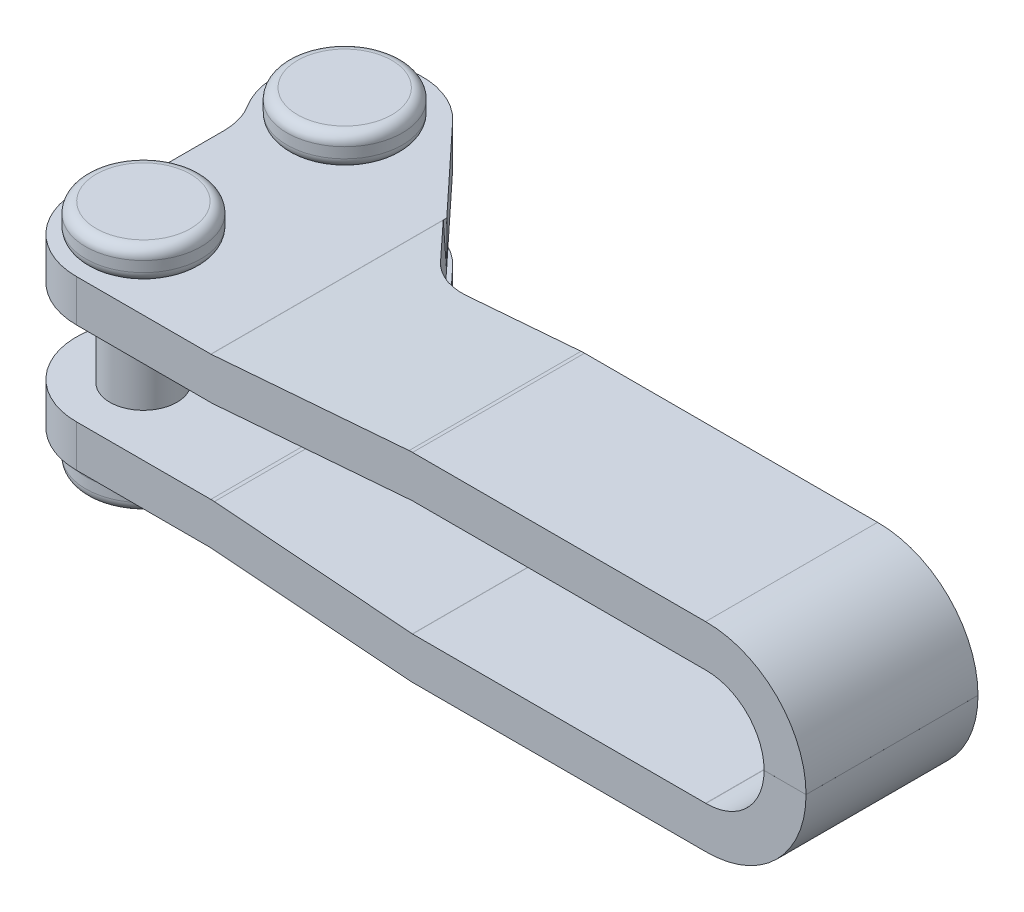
ISO-10303-21;
HEADER;
FILE_DESCRIPTION(('STEP AP214'),'2;1');
FILE_NAME('part.step','',(''),(''),'','','');
FILE_SCHEMA(('AUTOMOTIVE_DESIGN { 1 0 10303 214 1 1 1 1 }'));
ENDSEC;
DATA;
#1=APPLICATION_CONTEXT('core data for automotive mechanical design processes');
#2=APPLICATION_PROTOCOL_DEFINITION('international standard','automotive_design',2000,#1);
#3=PRODUCT_CONTEXT('',#1,'mechanical');
#4=PRODUCT('Part','Part','',(#3));
#5=PRODUCT_RELATED_PRODUCT_CATEGORY('part','',(#4));
#6=PRODUCT_DEFINITION_FORMATION('','',#4);
#7=PRODUCT_DEFINITION_CONTEXT('part definition',#1,'design');
#8=PRODUCT_DEFINITION('design','',#6,#7);
#9=PRODUCT_DEFINITION_SHAPE('','',#8);
#10=(LENGTH_UNIT() NAMED_UNIT(*) SI_UNIT(.MILLI.,.METRE.));
#11=(NAMED_UNIT(*) PLANE_ANGLE_UNIT() SI_UNIT($,.RADIAN.));
#12=(NAMED_UNIT(*) SI_UNIT($,.STERADIAN.) SOLID_ANGLE_UNIT());
#13=UNCERTAINTY_MEASURE_WITH_UNIT(LENGTH_MEASURE(1.E-05),#10,'distance_accuracy_value','');
#14=(GEOMETRIC_REPRESENTATION_CONTEXT(3) GLOBAL_UNCERTAINTY_ASSIGNED_CONTEXT((#13)) GLOBAL_UNIT_ASSIGNED_CONTEXT((#10,
#11,#12)) REPRESENTATION_CONTEXT('',''));
#15=CARTESIAN_POINT('',(0.,0.,0.));
#16=DIRECTION('',(0.,0.,1.));
#17=DIRECTION('',(1.,0.,0.));
#18=AXIS2_PLACEMENT_3D('',#15,#16,#17);
#19=CARTESIAN_POINT('',(-0.099999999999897,-4.5,9.5));
#20=DIRECTION('',(0.,1.,0.));
#21=DIRECTION('',(-0.727589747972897,0.,0.686012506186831));
#22=AXIS2_PLACEMENT_3D('',#19,#20,#21);
#23=CYLINDRICAL_SURFACE('',#22,1.6);
#24=CARTESIAN_POINT('',(-0.099999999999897,2.,9.5));
#25=DIRECTION('',(0.,-1.,0.));
#26=DIRECTION('',(1.,0.,0.));
#27=AXIS2_PLACEMENT_3D('',#24,#25,#26);
#28=CIRCLE('',#27,1.6);
#29=CARTESIAN_POINT('',(1.5000000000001,2.,9.5));
#30=VERTEX_POINT('',#29);
#31=EDGE_CURVE('E9',#30,#30,#28,.F.);
#32=ORIENTED_EDGE('',*,*,#31,.F.);
#33=EDGE_LOOP('',(#32));
#34=FACE_BOUND('',#33,.T.);
#35=CARTESIAN_POINT('',(-0.099999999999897,-2.,9.5));
#36=DIRECTION('',(0.,1.,0.));
#37=DIRECTION('',(0.,0.,-1.));
#38=AXIS2_PLACEMENT_3D('',#35,#36,#37);
#39=CIRCLE('',#38,1.6);
#40=CARTESIAN_POINT('',(-0.099999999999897,-2.,7.9));
#41=VERTEX_POINT('',#40);
#42=EDGE_CURVE('E26',#41,#41,#39,.F.);
#43=ORIENTED_EDGE('',*,*,#42,.F.);
#44=EDGE_LOOP('',(#43));
#45=FACE_BOUND('',#44,.T.);
#46=ADVANCED_FACE('F14',(#34,#45),#23,.T.);
#47=CARTESIAN_POINT('',(-0.099999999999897,5.5,9.5));
#48=DIRECTION('',(0.,-1.,0.));
#49=DIRECTION('',(0.727589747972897,0.,-0.686012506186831));
#50=AXIS2_PLACEMENT_3D('',#47,#48,#49);
#51=PLANE('',#50);
#52=CARTESIAN_POINT('',(-0.099999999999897,5.5,9.5));
#53=DIRECTION('',(0.,-1.,0.));
#54=DIRECTION('',(0.727589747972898,0.,-0.68601250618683));
#55=AXIS2_PLACEMENT_3D('',#52,#53,#54);
#56=CIRCLE('',#55,2.24999999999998);
#57=CARTESIAN_POINT('',(1.5370769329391,5.5,7.95647186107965));
#58=VERTEX_POINT('',#57);
#59=CARTESIAN_POINT('',(-1.73707693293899,5.5,11.0435281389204));
#60=VERTEX_POINT('',#59);
#61=EDGE_CURVE('E848',#58,#60,#56,.T.);
#62=ORIENTED_EDGE('',*,*,#61,.F.);
#63=CARTESIAN_POINT('',(-0.099999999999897,5.5,9.5));
#64=DIRECTION('',(0.,-1.,0.));
#65=DIRECTION('',(-0.727589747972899,0.,0.686012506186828));
#66=AXIS2_PLACEMENT_3D('',#63,#64,#65);
#67=CIRCLE('',#66,2.24999999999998);
#68=EDGE_CURVE('E850',#60,#58,#67,.T.);
#69=ORIENTED_EDGE('',*,*,#68,.F.);
#70=EDGE_LOOP('',(#62,#69));
#71=FACE_BOUND('',#70,.T.);
#72=ADVANCED_FACE('F875',(#71),#51,.F.);
#73=CARTESIAN_POINT('',(-0.099999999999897,5.,9.5));
#74=DIRECTION('',(0.,-1.,0.));
#75=DIRECTION('',(0.727589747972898,0.,-0.68601250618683));
#76=AXIS2_PLACEMENT_3D('',#73,#74,#75);
#77=TOROIDAL_SURFACE('',#76,2.24999999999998,0.5);
#78=ORIENTED_EDGE('',*,*,#61,.T.);
#79=ORIENTED_EDGE('',*,*,#68,.T.);
#80=EDGE_LOOP('',(#78,#79));
#81=FACE_BOUND('',#80,.T.);
#82=CARTESIAN_POINT('',(-0.099999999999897,5.,9.5));
#83=DIRECTION('',(0.,1.,0.));
#84=DIRECTION('',(-0.727589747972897,0.,0.686012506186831));
#85=AXIS2_PLACEMENT_3D('',#82,#83,#84);
#86=CIRCLE('',#85,2.75);
#87=CARTESIAN_POINT('',(-2.10087180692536,5.,11.3865343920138));
#88=VERTEX_POINT('',#87);
#89=EDGE_CURVE('E858',#88,#88,#86,.F.);
#90=ORIENTED_EDGE('',*,*,#89,.F.);
#91=EDGE_LOOP('',(#90));
#92=FACE_BOUND('',#91,.T.);
#93=ADVANCED_FACE('F885',(#81,#92),#77,.T.);
#94=CARTESIAN_POINT('',(-0.099999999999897,4.,9.5));
#95=DIRECTION('',(0.,1.,0.));
#96=DIRECTION('',(-0.727589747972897,0.,0.686012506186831));
#97=AXIS2_PLACEMENT_3D('',#94,#95,#96);
#98=CYLINDRICAL_SURFACE('',#97,2.75);
#99=CARTESIAN_POINT('',(-0.099999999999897,4.5,9.5));
#100=DIRECTION('',(0.,-1.,0.));
#101=DIRECTION('',(0.727589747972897,0.,-0.686012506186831));
#102=AXIS2_PLACEMENT_3D('',#99,#100,#101);
#103=CIRCLE('',#102,2.75);
#104=CARTESIAN_POINT('',(1.90087180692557,4.5,7.61346560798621));
#105=VERTEX_POINT('',#104);
#106=EDGE_CURVE('E922',#105,#105,#103,.T.);
#107=ORIENTED_EDGE('',*,*,#106,.F.);
#108=EDGE_LOOP('',(#107));
#109=FACE_BOUND('',#108,.T.);
#110=ORIENTED_EDGE('',*,*,#89,.T.);
#111=EDGE_LOOP('',(#110));
#112=FACE_BOUND('',#111,.T.);
#113=ADVANCED_FACE('F914',(#109,#112),#98,.T.);
#114=CARTESIAN_POINT('',(-0.099999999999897,4.5,9.5));
#115=DIRECTION('',(0.,-1.,0.));
#116=DIRECTION('',(0.727589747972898,0.,-0.68601250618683));
#117=AXIS2_PLACEMENT_3D('',#114,#115,#116);
#118=TOROIDAL_SURFACE('',#117,2.24999999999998,0.5);
#119=ORIENTED_EDGE('',*,*,#106,.T.);
#120=EDGE_LOOP('',(#119));
#121=FACE_BOUND('',#120,.T.);
#122=CARTESIAN_POINT('',(-0.099999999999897,4.,9.5));
#123=DIRECTION('',(0.,1.,0.));
#124=DIRECTION('',(0.727589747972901,0.,-0.686012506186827));
#125=AXIS2_PLACEMENT_3D('',#122,#123,#124);
#126=CIRCLE('',#125,2.24999999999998);
#127=CARTESIAN_POINT('',(-1.73707693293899,4.,11.0435281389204));
#128=VERTEX_POINT('',#127);
#129=CARTESIAN_POINT('',(1.5370769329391,4.,7.95647186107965));
#130=VERTEX_POINT('',#129);
#131=EDGE_CURVE('E34',#128,#130,#126,.F.);
#132=ORIENTED_EDGE('',*,*,#131,.F.);
#133=CARTESIAN_POINT('',(-0.099999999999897,4.,9.5));
#134=DIRECTION('',(0.,1.,0.));
#135=DIRECTION('',(-0.727589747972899,0.,0.686012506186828));
#136=AXIS2_PLACEMENT_3D('',#133,#134,#135);
#137=CIRCLE('',#136,2.24999999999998);
#138=EDGE_CURVE('E1847',#130,#128,#137,.F.);
#139=ORIENTED_EDGE('',*,*,#138,.F.);
#140=EDGE_LOOP('',(#132,#139));
#141=FACE_BOUND('',#140,.T.);
#142=ADVANCED_FACE('F939',(#121,#141),#118,.T.);
#143=CARTESIAN_POINT('',(-0.099999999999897,-5.5,9.5));
#144=DIRECTION('',(0.,1.,0.));
#145=DIRECTION('',(-0.727589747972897,0.,0.686012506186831));
#146=AXIS2_PLACEMENT_3D('',#143,#144,#145);
#147=PLANE('',#146);
#148=CARTESIAN_POINT('',(-0.099999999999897,-5.5,9.5));
#149=DIRECTION('',(0.,1.,0.));
#150=DIRECTION('',(-0.727589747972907,0.,0.68601250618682));
#151=AXIS2_PLACEMENT_3D('',#148,#149,#150);
#152=CIRCLE('',#151,2.25000000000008);
#153=CARTESIAN_POINT('',(-1.73707693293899,-5.5,11.0435281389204));
#154=VERTEX_POINT('',#153);
#155=CARTESIAN_POINT('',(1.5370769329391,-5.5,7.95647186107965));
#156=VERTEX_POINT('',#155);
#157=EDGE_CURVE('E842',#154,#156,#152,.T.);
#158=ORIENTED_EDGE('',*,*,#157,.F.);
#159=CARTESIAN_POINT('',(-0.099999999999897,-5.5,9.5));
#160=DIRECTION('',(0.,1.,0.));
#161=DIRECTION('',(0.727589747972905,0.,-0.686012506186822));
#162=AXIS2_PLACEMENT_3D('',#159,#160,#161);
#163=CIRCLE('',#162,2.25000000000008);
#164=EDGE_CURVE('E843',#156,#154,#163,.T.);
#165=ORIENTED_EDGE('',*,*,#164,.F.);
#166=EDGE_LOOP('',(#158,#165));
#167=FACE_BOUND('',#166,.T.);
#168=ADVANCED_FACE('F889',(#167),#147,.F.);
#169=CARTESIAN_POINT('',(-0.099999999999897,-5.,9.5));
#170=DIRECTION('',(0.,1.,0.));
#171=DIRECTION('',(-0.727589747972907,0.,0.68601250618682));
#172=AXIS2_PLACEMENT_3D('',#169,#170,#171);
#173=TOROIDAL_SURFACE('',#172,2.25000000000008,0.5);
#174=ORIENTED_EDGE('',*,*,#157,.T.);
#175=ORIENTED_EDGE('',*,*,#164,.T.);
#176=EDGE_LOOP('',(#174,#175));
#177=FACE_BOUND('',#176,.T.);
#178=CARTESIAN_POINT('',(-0.099999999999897,-5.,9.5));
#179=DIRECTION('',(0.,-1.,0.));
#180=DIRECTION('',(0.727589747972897,0.,-0.686012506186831));
#181=AXIS2_PLACEMENT_3D('',#178,#179,#180);
#182=CIRCLE('',#181,2.75);
#183=CARTESIAN_POINT('',(1.90087180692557,-5.,7.61346560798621));
#184=VERTEX_POINT('',#183);
#185=EDGE_CURVE('E855',#184,#184,#182,.F.);
#186=ORIENTED_EDGE('',*,*,#185,.F.);
#187=EDGE_LOOP('',(#186));
#188=FACE_BOUND('',#187,.T.);
#189=ADVANCED_FACE('F886',(#177,#188),#173,.T.);
#190=CARTESIAN_POINT('',(-0.099999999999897,-4.,9.5));
#191=DIRECTION('',(0.,-1.,0.));
#192=DIRECTION('',(0.727589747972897,0.,-0.686012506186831));
#193=AXIS2_PLACEMENT_3D('',#190,#191,#192);
#194=CYLINDRICAL_SURFACE('',#193,2.75);
#195=CARTESIAN_POINT('',(-0.099999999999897,-4.5,9.5));
#196=DIRECTION('',(0.,1.,0.));
#197=DIRECTION('',(-0.727589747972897,0.,0.686012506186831));
#198=AXIS2_PLACEMENT_3D('',#195,#196,#197);
#199=CIRCLE('',#198,2.75);
#200=CARTESIAN_POINT('',(-2.10087180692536,-4.5,11.3865343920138));
#201=VERTEX_POINT('',#200);
#202=EDGE_CURVE('E863',#201,#201,#199,.T.);
#203=ORIENTED_EDGE('',*,*,#202,.F.);
#204=EDGE_LOOP('',(#203));
#205=FACE_BOUND('',#204,.T.);
#206=ORIENTED_EDGE('',*,*,#185,.T.);
#207=EDGE_LOOP('',(#206));
#208=FACE_BOUND('',#207,.T.);
#209=ADVANCED_FACE('F915',(#205,#208),#194,.T.);
#210=CARTESIAN_POINT('',(-0.099999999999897,-4.5,9.5));
#211=DIRECTION('',(0.,1.,0.));
#212=DIRECTION('',(-0.727589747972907,0.,0.68601250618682));
#213=AXIS2_PLACEMENT_3D('',#210,#211,#212);
#214=TOROIDAL_SURFACE('',#213,2.25000000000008,0.5);
#215=ORIENTED_EDGE('',*,*,#202,.T.);
#216=EDGE_LOOP('',(#215));
#217=FACE_BOUND('',#216,.T.);
#218=CARTESIAN_POINT('',(-0.099999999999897,-4.,9.5));
#219=DIRECTION('',(0.,-1.,0.));
#220=DIRECTION('',(-0.727589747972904,0.,0.686012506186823));
#221=AXIS2_PLACEMENT_3D('',#218,#219,#220);
#222=CIRCLE('',#221,2.25000000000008);
#223=CARTESIAN_POINT('',(1.5370769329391,-4.,7.95647186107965));
#224=VERTEX_POINT('',#223);
#225=CARTESIAN_POINT('',(-1.73707693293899,-4.,11.0435281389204));
#226=VERTEX_POINT('',#225);
#227=EDGE_CURVE('E1845',#224,#226,#222,.F.);
#228=ORIENTED_EDGE('',*,*,#227,.F.);
#229=CARTESIAN_POINT('',(-0.099999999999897,-4.,9.5));
#230=DIRECTION('',(0.,-1.,0.));
#231=DIRECTION('',(0.727589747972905,0.,-0.686012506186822));
#232=AXIS2_PLACEMENT_3D('',#229,#230,#231);
#233=CIRCLE('',#232,2.25000000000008);
#234=EDGE_CURVE('E418',#226,#224,#233,.F.);
#235=ORIENTED_EDGE('',*,*,#234,.F.);
#236=EDGE_LOOP('',(#228,#235));
#237=FACE_BOUND('',#236,.T.);
#238=ADVANCED_FACE('F567',(#217,#237),#214,.T.);
#239=CARTESIAN_POINT('',(0.,-5.5,0.));
#240=DIRECTION('',(0.,1.,0.));
#241=DIRECTION('',(-0.0839480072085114,0.,0.996470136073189));
#242=AXIS2_PLACEMENT_3D('',#239,#240,#241);
#243=PLANE('',#242);
#244=CARTESIAN_POINT('',(0.,-5.5,0.));
#245=DIRECTION('',(0.,1.,0.));
#246=DIRECTION('',(-0.0839480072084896,0.,0.996470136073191));
#247=AXIS2_PLACEMENT_3D('',#244,#245,#246);
#248=CIRCLE('',#247,2.25000000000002);
#249=CARTESIAN_POINT('',(-0.188883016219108,-5.5,2.24205780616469));
#250=VERTEX_POINT('',#249);
#251=CARTESIAN_POINT('',(0.188883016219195,-5.5,-2.24205780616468));
#252=VERTEX_POINT('',#251);
#253=EDGE_CURVE('E516',#250,#252,#248,.T.);
#254=ORIENTED_EDGE('',*,*,#253,.F.);
#255=CARTESIAN_POINT('',(0.,-5.5,0.));
#256=DIRECTION('',(0.,1.,0.));
#257=DIRECTION('',(0.0839480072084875,0.,-0.996470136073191));
#258=AXIS2_PLACEMENT_3D('',#255,#256,#257);
#259=CIRCLE('',#258,2.25000000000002);
#260=EDGE_CURVE('E553',#252,#250,#259,.T.);
#261=ORIENTED_EDGE('',*,*,#260,.F.);
#262=EDGE_LOOP('',(#254,#261));
#263=FACE_BOUND('',#262,.T.);
#264=ADVANCED_FACE('F535',(#263),#243,.F.);
#265=CARTESIAN_POINT('',(0.,5.5,0.));
#266=DIRECTION('',(0.,-1.,0.));
#267=DIRECTION('',(0.0839480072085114,0.,-0.996470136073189));
#268=AXIS2_PLACEMENT_3D('',#265,#266,#267);
#269=PLANE('',#268);
#270=CARTESIAN_POINT('',(0.,5.5,0.));
#271=DIRECTION('',(0.,-1.,0.));
#272=DIRECTION('',(0.083948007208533,0.,-0.996470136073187));
#273=AXIS2_PLACEMENT_3D('',#270,#271,#272);
#274=CIRCLE('',#273,2.25000000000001);
#275=CARTESIAN_POINT('',(0.188883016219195,5.5,-2.24205780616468));
#276=VERTEX_POINT('',#275);
#277=CARTESIAN_POINT('',(-0.188883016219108,5.5,2.24205780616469));
#278=VERTEX_POINT('',#277);
#279=EDGE_CURVE('E588',#276,#278,#274,.T.);
#280=ORIENTED_EDGE('',*,*,#279,.F.);
#281=CARTESIAN_POINT('',(0.,5.5,0.));
#282=DIRECTION('',(0.,-1.,0.));
#283=DIRECTION('',(-0.0839480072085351,0.,0.996470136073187));
#284=AXIS2_PLACEMENT_3D('',#281,#282,#283);
#285=CIRCLE('',#284,2.25000000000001);
#286=EDGE_CURVE('E599',#278,#276,#285,.T.);
#287=ORIENTED_EDGE('',*,*,#286,.F.);
#288=EDGE_LOOP('',(#280,#287));
#289=FACE_BOUND('',#288,.T.);
#290=ADVANCED_FACE('F394',(#289),#269,.F.);
#291=CARTESIAN_POINT('',(0.,-5.,0.));
#292=DIRECTION('',(0.,1.,0.));
#293=DIRECTION('',(-0.0839480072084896,0.,0.996470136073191));
#294=AXIS2_PLACEMENT_3D('',#291,#292,#293);
#295=TOROIDAL_SURFACE('',#294,2.25000000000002,0.5);
#296=ORIENTED_EDGE('',*,*,#253,.T.);
#297=ORIENTED_EDGE('',*,*,#260,.T.);
#298=EDGE_LOOP('',(#296,#297));
#299=FACE_BOUND('',#298,.T.);
#300=CARTESIAN_POINT('',(0.,-5.,0.));
#301=DIRECTION('',(0.,-1.,0.));
#302=DIRECTION('',(0.0839480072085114,0.,-0.996470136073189));
#303=AXIS2_PLACEMENT_3D('',#300,#301,#302);
#304=CIRCLE('',#303,2.75);
#305=CARTESIAN_POINT('',(0.230857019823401,-5.,-2.74029287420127));
#306=VERTEX_POINT('',#305);
#307=EDGE_CURVE('E546',#306,#306,#304,.F.);
#308=ORIENTED_EDGE('',*,*,#307,.F.);
#309=EDGE_LOOP('',(#308));
#310=FACE_BOUND('',#309,.T.);
#311=ADVANCED_FACE('F523',(#299,#310),#295,.T.);
#312=CARTESIAN_POINT('',(0.,5.,0.));
#313=DIRECTION('',(0.,-1.,0.));
#314=DIRECTION('',(0.083948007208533,0.,-0.996470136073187));
#315=AXIS2_PLACEMENT_3D('',#312,#313,#314);
#316=TOROIDAL_SURFACE('',#315,2.25000000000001,0.5);
#317=ORIENTED_EDGE('',*,*,#279,.T.);
#318=ORIENTED_EDGE('',*,*,#286,.T.);
#319=EDGE_LOOP('',(#317,#318));
#320=FACE_BOUND('',#319,.T.);
#321=CARTESIAN_POINT('',(0.,5.,0.));
#322=DIRECTION('',(0.,1.,0.));
#323=DIRECTION('',(-0.0839480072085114,0.,0.996470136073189));
#324=AXIS2_PLACEMENT_3D('',#321,#322,#323);
#325=CIRCLE('',#324,2.75);
#326=CARTESIAN_POINT('',(-0.230857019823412,5.,2.74029287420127));
#327=VERTEX_POINT('',#326);
#328=EDGE_CURVE('E548',#327,#327,#325,.F.);
#329=ORIENTED_EDGE('',*,*,#328,.F.);
#330=EDGE_LOOP('',(#329));
#331=FACE_BOUND('',#330,.T.);
#332=ADVANCED_FACE('F534',(#320,#331),#316,.T.);
#333=CARTESIAN_POINT('',(6.2431101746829,3.99383689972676,4.5));
#334=DIRECTION('',(0.,0.,1.));
#335=DIRECTION('',(0.,-1.,0.));
#336=AXIS2_PLACEMENT_3D('',#333,#334,#335);
#337=PLANE('',#336);
#338=DIRECTION('',(-0.996918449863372,-0.0784449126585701,0.));
#339=VECTOR('',#338,1.);
#340=CARTESIAN_POINT('',(15.7686230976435,4.74337466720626,4.5));
#341=LINE('',#340,#339);
#342=CARTESIAN_POINT('',(15.7686230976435,4.74337466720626,4.5));
#343=VERTEX_POINT('',#342);
#344=CARTESIAN_POINT('',(10.3092658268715,4.3137920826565,4.5));
#345=VERTEX_POINT('',#344);
#346=EDGE_CURVE('E1047',#343,#345,#341,.T.);
#347=ORIENTED_EDGE('',*,*,#346,.F.);
#348=CARTESIAN_POINT('',(15.9372796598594,2.6,4.5));
#349=DIRECTION('',(0.,0.,1.));
#350=DIRECTION('',(0.,-1.,0.));
#351=AXIS2_PLACEMENT_3D('',#348,#349,#350);
#352=CIRCLE('',#351,2.15);
#353=CARTESIAN_POINT('',(15.9372796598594,4.75,4.5));
#354=VERTEX_POINT('',#353);
#355=EDGE_CURVE('E1080',#343,#354,#352,.F.);
#356=ORIENTED_EDGE('',*,*,#355,.T.);
#357=DIRECTION('',(1.,0.,0.));
#358=VECTOR('',#357,1.);
#359=CARTESIAN_POINT('',(15.9313872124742,4.75,4.5));
#360=LINE('',#359,#358);
#361=CARTESIAN_POINT('',(29.9099543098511,4.75,4.5));
#362=VERTEX_POINT('',#361);
#363=EDGE_CURVE('E1091',#362,#354,#360,.F.);
#364=ORIENTED_EDGE('',*,*,#363,.F.);
#365=DIRECTION('',(1.,0.,0.));
#366=VECTOR('',#365,1.);
#367=CARTESIAN_POINT('',(29.9099543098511,4.75,4.5));
#368=LINE('',#367,#366);
#369=CARTESIAN_POINT('',(29.9111802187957,4.75000250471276,4.5));
#370=VERTEX_POINT('',#369);
#371=EDGE_CURVE('E1101',#362,#370,#368,.T.);
#372=ORIENTED_EDGE('',*,*,#371,.T.);
#373=CARTESIAN_POINT('',(29.95,0.00016364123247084,4.5));
#374=DIRECTION('',(0.,0.,1.));
#375=DIRECTION('',(0.,-1.,0.));
#376=AXIS2_PLACEMENT_3D('',#373,#374,#375);
#377=CIRCLE('',#376,4.75);
#378=CARTESIAN_POINT('',(34.7,0.00016364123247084,4.5));
#379=VERTEX_POINT('',#378);
#380=EDGE_CURVE('E1108',#370,#379,#377,.F.);
#381=ORIENTED_EDGE('',*,*,#380,.T.);
#382=DIRECTION('',(1.,0.,0.));
#383=VECTOR('',#382,1.);
#384=CARTESIAN_POINT('',(29.95,0.00016364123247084,4.5));
#385=LINE('',#384,#383);
#386=CARTESIAN_POINT('',(32.7,0.00016364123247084,4.5));
#387=VERTEX_POINT('',#386);
#388=EDGE_CURVE('E1105',#379,#387,#385,.F.);
#389=ORIENTED_EDGE('',*,*,#388,.T.);
#390=CARTESIAN_POINT('',(29.95,0.00016364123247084,4.5));
#391=DIRECTION('',(0.,0.,1.));
#392=DIRECTION('',(0.,-1.,0.));
#393=AXIS2_PLACEMENT_3D('',#390,#391,#392);
#394=CIRCLE('',#393,2.75);
#395=CARTESIAN_POINT('',(29.9275253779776,2.75007180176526,4.5));
#396=VERTEX_POINT('',#395);
#397=EDGE_CURVE('E1111',#387,#396,#394,.T.);
#398=ORIENTED_EDGE('',*,*,#397,.T.);
#399=CARTESIAN_POINT('',(29.9099543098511,4.9,4.5));
#400=DIRECTION('',(0.,0.,-1.));
#401=DIRECTION('',(0.,1.,0.));
#402=AXIS2_PLACEMENT_3D('',#399,#400,#401);
#403=CIRCLE('',#402,2.15);
#404=CARTESIAN_POINT('',(29.9099543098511,2.75,4.5));
#405=VERTEX_POINT('',#404);
#406=EDGE_CURVE('E1212',#396,#405,#403,.T.);
#407=ORIENTED_EDGE('',*,*,#406,.T.);
#408=DIRECTION('',(-1.,0.,0.));
#409=VECTOR('',#408,1.);
#410=CARTESIAN_POINT('',(15.9313872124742,2.75,4.5));
#411=LINE('',#410,#409);
#412=CARTESIAN_POINT('',(15.9372796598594,2.75,4.5));
#413=VERTEX_POINT('',#412);
#414=EDGE_CURVE('E1087',#413,#405,#411,.F.);
#415=ORIENTED_EDGE('',*,*,#414,.F.);
#416=CARTESIAN_POINT('',(15.9372796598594,2.6,4.5));
#417=DIRECTION('',(0.,0.,-1.));
#418=DIRECTION('',(0.,1.,0.));
#419=AXIS2_PLACEMENT_3D('',#416,#417,#418);
#420=CIRCLE('',#419,0.15);
#421=CARTESIAN_POINT('',(15.9255129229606,2.7495377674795,4.5));
#422=VERTEX_POINT('',#421);
#423=EDGE_CURVE('E1090',#413,#422,#420,.F.);
#424=ORIENTED_EDGE('',*,*,#423,.T.);
#425=DIRECTION('',(-0.996918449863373,-0.0784449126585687,0.));
#426=VECTOR('',#425,1.);
#427=CARTESIAN_POINT('',(6.4,2.,4.5));
#428=LINE('',#427,#426);
#429=CARTESIAN_POINT('',(10.4661556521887,2.31995518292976,4.5));
#430=VERTEX_POINT('',#429);
#431=EDGE_CURVE('E1027',#430,#422,#428,.F.);
#432=ORIENTED_EDGE('',*,*,#431,.F.);
#433=DIRECTION('',(0.0784449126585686,-0.996918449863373,0.));
#434=VECTOR('',#433,1.);
#435=CARTESIAN_POINT('',(10.3092658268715,4.3137920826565,4.5));
#436=LINE('',#435,#434);
#437=EDGE_CURVE('E1045',#345,#430,#436,.T.);
#438=ORIENTED_EDGE('',*,*,#437,.F.);
#439=EDGE_LOOP('',(#347,#356,#364,#372,#381,#389,#398,#407,#415,#424,#432,#438));
#440=FACE_BOUND('',#439,.T.);
#441=ADVANCED_FACE('F393',(#440),#337,.F.);
#442=CARTESIAN_POINT('',(8.115204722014,4.1411471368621,3.54599508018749));
#443=CARTESIAN_POINT('',(8.27209454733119,2.14731023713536,3.54599508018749));
#444=CARTESIAN_POINT('',(8.69093093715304,4.18644953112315,4.16338585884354));
#445=CARTESIAN_POINT('',(8.84782076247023,2.19261263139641,4.16338585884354));
#446=CARTESIAN_POINT('',(9.46509046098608,4.24736612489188,4.5));
#447=CARTESIAN_POINT('',(9.62198028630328,2.25352922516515,4.5));
#448=CARTESIAN_POINT('',(10.3092658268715,4.3137920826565,4.5));
#449=CARTESIAN_POINT('',(10.4661556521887,2.31995518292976,4.5));
#450=(BOUNDED_SURFACE() B_SPLINE_SURFACE(3,1,((#442,#443),(#444,#445),(#446,#447),(#448,#449)),
.UNSPECIFIED.,.F.,.F.,.F.) B_SPLINE_SURFACE_WITH_KNOTS((4,4),(2,2),(0.,1.),(0.,1.),
.UNSPECIFIED.) GEOMETRIC_REPRESENTATION_ITEM() RATIONAL_B_SPLINE_SURFACE(((1.,1.),
(0.944706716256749,0.944706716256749),(0.944706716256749,0.944706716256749),(1.,1.))) REPRESENTATION_ITEM('') SURFACE());
#451=CARTESIAN_POINT('',(8.27209454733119,2.14731023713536,3.54599508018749));
#452=CARTESIAN_POINT('',(8.32993996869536,2.15186194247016,3.60803894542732));
#453=CARTESIAN_POINT('',(8.3904183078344,2.1566208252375,3.66760659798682));
#454=CARTESIAN_POINT('',(8.51617900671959,2.16651660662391,3.78139630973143));
#455=CARTESIAN_POINT('',(8.58146122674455,2.17165349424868,3.83561852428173));
#456=CARTESIAN_POINT('',(8.71638396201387,2.18227021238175,3.93833749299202));
#457=CARTESIAN_POINT('',(8.78602529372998,2.18775010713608,3.98683316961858));
#458=CARTESIAN_POINT('',(8.92912279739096,2.19901007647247,4.07773599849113));
#459=CARTESIAN_POINT('',(9.00257880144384,2.20479013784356,4.12014341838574));
#460=CARTESIAN_POINT('',(9.22732733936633,2.2224750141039,4.2374694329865));
#461=CARTESIAN_POINT('',(9.38363532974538,2.23477448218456,4.30297368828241));
#462=CARTESIAN_POINT('',(9.7047354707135,2.26004101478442,4.40665707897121));
#463=CARTESIAN_POINT('',(9.86951328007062,2.2730069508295,4.44488087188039));
#464=CARTESIAN_POINT('',(10.1073895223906,2.29172481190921,4.4793435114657));
#465=CARTESIAN_POINT('',(10.1789738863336,2.29735759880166,4.48709077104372));
#466=CARTESIAN_POINT('',(10.3224141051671,2.30864453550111,4.49741464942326));
#467=CARTESIAN_POINT('',(10.3942694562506,2.31429864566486,4.49999830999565));
#468=CARTESIAN_POINT('',(10.4661556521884,2.31995518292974,4.5));
#469=B_SPLINE_CURVE_WITH_KNOTS('',3,(#451,#452,#453,#454,#455,#456,#457,#458,#459,#460,#461,
#462,#463,#464,#465,#466,#467,#468),.UNSPECIFIED.,.F.,.F.,(4,2,2,2,2,2,2,2,4),(0.,
0.254761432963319,0.509515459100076,0.764317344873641,1.01910802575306,1.52632404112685,
2.03270783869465,2.24922056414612,2.46543782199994),.UNSPECIFIED.);
#470=CARTESIAN_POINT('',(8.27209454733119,2.14731023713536,3.54599508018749));
#471=VERTEX_POINT('',#470);
#472=EDGE_CURVE('E1031',#471,#430,#469,.T.);
#473=DIRECTION('',(-0.0784449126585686,0.996918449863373,0.));
#474=VECTOR('',#473,1.);
#475=CARTESIAN_POINT('',(8.27209454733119,2.14731023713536,3.54599508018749));
#476=LINE('',#475,#474);
#477=CARTESIAN_POINT('',(8.11520472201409,4.1411471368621,3.54599508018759));
#478=VERTEX_POINT('',#477);
#479=EDGE_CURVE('E1039',#471,#478,#476,.T.);
#480=CARTESIAN_POINT('',(10.3092658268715,4.3137920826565,4.5));
#481=CARTESIAN_POINT('',(10.2246029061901,4.30713017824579,4.50000811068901));
#482=CARTESIAN_POINT('',(10.1399435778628,4.30046855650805,4.49641617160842));
#483=CARTESIAN_POINT('',(9.97122781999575,4.28719275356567,4.48209414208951));
#484=CARTESIAN_POINT('',(9.88717138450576,4.28057857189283,4.47136412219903));
#485=CARTESIAN_POINT('',(9.72021975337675,4.26744158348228,4.44282177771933));
#486=CARTESIAN_POINT('',(9.63732506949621,4.26091881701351,4.42500642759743));
#487=CARTESIAN_POINT('',(9.47335223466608,4.24801622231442,4.38243494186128));
#488=CARTESIAN_POINT('',(9.3922739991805,4.24163638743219,4.35767912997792));
#489=CARTESIAN_POINT('',(9.15270999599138,4.2227857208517,4.27326199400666));
#490=CARTESIAN_POINT('',(8.99766663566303,4.21058576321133,4.20341170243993));
#491=CARTESIAN_POINT('',(8.70178804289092,4.18730384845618,4.03862890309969));
#492=CARTESIAN_POINT('',(8.56092849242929,4.17621997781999,3.9437403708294));
#493=CARTESIAN_POINT('',(8.37339683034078,4.16146360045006,3.79293454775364));
#494=CARTESIAN_POINT('',(8.3192680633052,4.1572043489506,3.74611504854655));
#495=CARTESIAN_POINT('',(8.21455063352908,4.14896440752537,3.6487820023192));
#496=CARTESIAN_POINT('',(8.16395742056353,4.14498335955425,3.59827338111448));
#497=CARTESIAN_POINT('',(8.1152047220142,4.1411471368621,3.54599508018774));
#498=B_SPLINE_CURVE_WITH_KNOTS('',3,(#480,#481,#482,#483,#484,#485,#486,#487,#488,#489,#490,
#491,#492,#493,#494,#495,#496,#497),.UNSPECIFIED.,.F.,.F.,(4,2,2,2,2,2,2,2,4),(0.,
0.254691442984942,0.50938036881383,0.764178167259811,1.01896408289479,1.52784779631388,
2.03584362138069,2.25077589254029,2.46542624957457),.UNSPECIFIED.);
#499=EDGE_CURVE('E1048',#345,#478,#498,.T.);
#500=ORIENTED_EDGE('',*,*,#472,.F.);
#501=ORIENTED_EDGE('',*,*,#479,.T.);
#502=ORIENTED_EDGE('',*,*,#499,.F.);
#503=ORIENTED_EDGE('',*,*,#437,.T.);
#504=EDGE_LOOP('',(#500,#501,#502,#503));
#505=FACE_BOUND('',#504,.T.);
#506=ADVANCED_FACE('F808',(#505),#450,.T.);
#507=CARTESIAN_POINT('',(3.744938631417,1.79108014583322,-1.308785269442));
#508=DIRECTION('',(-0.728052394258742,-0.0572885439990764,0.683123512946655));
#509=DIRECTION('',(0.684247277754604,0.,0.729250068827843));
#510=AXIS2_PLACEMENT_3D('',#507,#508,#509);
#511=PLANE('',#510);
#512=DIRECTION('',(0.078444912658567,-0.996918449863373,0.));
#513=VECTOR('',#512,1.);
#514=CARTESIAN_POINT('',(6.4057532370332,3.00354378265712,1.62871092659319));
#515=LINE('',#514,#513);
#516=CARTESIAN_POINT('',(6.3273083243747,4.0004622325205,1.62871092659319));
#517=VERTEX_POINT('',#516);
#518=CARTESIAN_POINT('',(6.48419814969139,2.00662533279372,1.62871092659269));
#519=VERTEX_POINT('',#518);
#520=EDGE_CURVE('E1051',#517,#519,#515,.T.);
#521=ORIENTED_EDGE('',*,*,#520,.F.);
#522=DIRECTION('',(-0.681018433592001,-0.0535875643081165,-0.730302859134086));
#523=VECTOR('',#522,1.);
#524=CARTESIAN_POINT('',(8.115204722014,4.14114713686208,3.54599508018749));
#525=LINE('',#524,#523);
#526=EDGE_CURVE('E1042',#478,#517,#525,.T.);
#527=ORIENTED_EDGE('',*,*,#526,.F.);
#528=ORIENTED_EDGE('',*,*,#479,.F.);
#529=DIRECTION('',(0.681018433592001,0.0535875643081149,0.730302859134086));
#530=VECTOR('',#529,1.);
#531=CARTESIAN_POINT('',(6.48419814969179,2.00662533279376,1.62871092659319));
#532=LINE('',#531,#530);
#533=EDGE_CURVE('E1023',#519,#471,#532,.T.);
#534=ORIENTED_EDGE('',*,*,#533,.F.);
#535=EDGE_LOOP('',(#521,#527,#528,#534));
#536=FACE_BOUND('',#535,.T.);
#537=ADVANCED_FACE('F692',(#536),#511,.F.);
#538=CARTESIAN_POINT('',(6.4,-2.,4.5));
#539=DIRECTION('',(0.,0.,1.));
#540=DIRECTION('',(0.,-1.,0.));
#541=AXIS2_PLACEMENT_3D('',#538,#539,#540);
#542=PLANE('',#541);
#543=DIRECTION('',(-0.0784449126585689,-0.996918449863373,0.));
#544=VECTOR('',#543,1.);
#545=CARTESIAN_POINT('',(10.4661556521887,-2.31995518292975,4.5));
#546=LINE('',#545,#544);
#547=CARTESIAN_POINT('',(10.4661556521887,-2.31995518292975,4.5));
#548=VERTEX_POINT('',#547);
#549=CARTESIAN_POINT('',(10.3092658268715,-4.31379208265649,4.5));
#550=VERTEX_POINT('',#549);
#551=EDGE_CURVE('E1797',#548,#550,#546,.T.);
#552=ORIENTED_EDGE('',*,*,#551,.F.);
#553=DIRECTION('',(-0.996918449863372,0.0784449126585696,0.));
#554=VECTOR('',#553,1.);
#555=CARTESIAN_POINT('',(15.9255129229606,-2.74953776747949,4.5));
#556=LINE('',#555,#554);
#557=CARTESIAN_POINT('',(15.9255129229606,-2.74953776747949,4.5));
#558=VERTEX_POINT('',#557);
#559=EDGE_CURVE('E1800',#558,#548,#556,.T.);
#560=ORIENTED_EDGE('',*,*,#559,.F.);
#561=CARTESIAN_POINT('',(15.9372796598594,-2.6,4.5));
#562=DIRECTION('',(0.,0.,-1.));
#563=DIRECTION('',(0.,1.,0.));
#564=AXIS2_PLACEMENT_3D('',#561,#562,#563);
#565=CIRCLE('',#564,0.15);
#566=CARTESIAN_POINT('',(15.9372796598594,-2.75,4.5));
#567=VERTEX_POINT('',#566);
#568=EDGE_CURVE('E725',#558,#567,#565,.F.);
#569=ORIENTED_EDGE('',*,*,#568,.T.);
#570=DIRECTION('',(1.,0.,0.));
#571=VECTOR('',#570,1.);
#572=CARTESIAN_POINT('',(15.9313872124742,-2.75,4.5));
#573=LINE('',#572,#571);
#574=CARTESIAN_POINT('',(29.909954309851,-2.75,4.5));
#575=VERTEX_POINT('',#574);
#576=EDGE_CURVE('E737',#575,#567,#573,.F.);
#577=ORIENTED_EDGE('',*,*,#576,.F.);
#578=CARTESIAN_POINT('',(29.909954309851,-4.9,4.5));
#579=DIRECTION('',(0.,0.,-1.));
#580=DIRECTION('',(0.,1.,0.));
#581=AXIS2_PLACEMENT_3D('',#578,#579,#580);
#582=CIRCLE('',#581,2.15);
#583=CARTESIAN_POINT('',(29.9275253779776,-2.75007180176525,4.5));
#584=VERTEX_POINT('',#583);
#585=EDGE_CURVE('E739',#575,#584,#582,.T.);
#586=ORIENTED_EDGE('',*,*,#585,.T.);
#587=CARTESIAN_POINT('',(29.95,-0.000163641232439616,4.5));
#588=DIRECTION('',(0.,0.,-1.));
#589=DIRECTION('',(0.,1.,0.));
#590=AXIS2_PLACEMENT_3D('',#587,#588,#589);
#591=CIRCLE('',#590,2.75);
#592=CARTESIAN_POINT('',(32.7,-0.000163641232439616,4.5));
#593=VERTEX_POINT('',#592);
#594=EDGE_CURVE('E369',#584,#593,#591,.F.);
#595=ORIENTED_EDGE('',*,*,#594,.T.);
#596=DIRECTION('',(1.,0.,0.));
#597=VECTOR('',#596,1.);
#598=CARTESIAN_POINT('',(29.95,-0.000163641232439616,4.5));
#599=LINE('',#598,#597);
#600=CARTESIAN_POINT('',(34.7,-0.000163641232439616,4.5));
#601=VERTEX_POINT('',#600);
#602=EDGE_CURVE('E349',#593,#601,#599,.T.);
#603=ORIENTED_EDGE('',*,*,#602,.T.);
#604=CARTESIAN_POINT('',(29.95,-0.000163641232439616,4.5));
#605=DIRECTION('',(0.,0.,-1.));
#606=DIRECTION('',(0.,1.,0.));
#607=AXIS2_PLACEMENT_3D('',#604,#605,#606);
#608=CIRCLE('',#607,4.75);
#609=CARTESIAN_POINT('',(29.9111801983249,-4.75000500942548,4.5));
#610=VERTEX_POINT('',#609);
#611=EDGE_CURVE('E745',#610,#601,#608,.F.);
#612=ORIENTED_EDGE('',*,*,#611,.F.);
#613=DIRECTION('',(1.,0.,0.));
#614=VECTOR('',#613,1.);
#615=CARTESIAN_POINT('',(29.909954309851,-4.75000500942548,4.5));
#616=LINE('',#615,#614);
#617=CARTESIAN_POINT('',(29.909954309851,-4.75000250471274,4.5));
#618=VERTEX_POINT('',#617);
#619=EDGE_CURVE('E735',#610,#618,#616,.F.);
#620=ORIENTED_EDGE('',*,*,#619,.T.);
#621=DIRECTION('',(-1.,0.,0.));
#622=VECTOR('',#621,1.);
#623=CARTESIAN_POINT('',(15.9313872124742,-4.75,4.5));
#624=LINE('',#623,#622);
#625=CARTESIAN_POINT('',(15.9372796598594,-4.75,4.5));
#626=VERTEX_POINT('',#625);
#627=EDGE_CURVE('E728',#618,#626,#624,.T.);
#628=ORIENTED_EDGE('',*,*,#627,.T.);
#629=CARTESIAN_POINT('',(15.9372796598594,-2.6,4.5));
#630=DIRECTION('',(0.,0.,-1.));
#631=DIRECTION('',(0.,1.,0.));
#632=AXIS2_PLACEMENT_3D('',#629,#630,#631);
#633=CIRCLE('',#632,2.15);
#634=CARTESIAN_POINT('',(15.7686230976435,-4.74337466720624,4.5));
#635=VERTEX_POINT('',#634);
#636=EDGE_CURVE('E723',#635,#626,#633,.F.);
#637=ORIENTED_EDGE('',*,*,#636,.F.);
#638=DIRECTION('',(-0.996918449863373,0.0784449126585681,0.));
#639=VECTOR('',#638,1.);
#640=CARTESIAN_POINT('',(6.2431101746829,-3.99383689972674,4.5));
#641=LINE('',#640,#639);
#642=EDGE_CURVE('E662',#635,#550,#641,.T.);
#643=ORIENTED_EDGE('',*,*,#642,.T.);
#644=EDGE_LOOP('',(#552,#560,#569,#577,#586,#595,#603,#612,#620,#628,#637,#643));
#645=FACE_BOUND('',#644,.T.);
#646=ADVANCED_FACE('F689',(#645),#542,.F.);
#647=CARTESIAN_POINT('',(10.3092658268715,-4.31379208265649,4.5));
#648=CARTESIAN_POINT('',(10.4661556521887,-2.31995518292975,4.5));
#649=CARTESIAN_POINT('',(9.46509046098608,-4.24736612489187,4.5));
#650=CARTESIAN_POINT('',(9.62198028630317,-2.25352922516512,4.5));
#651=CARTESIAN_POINT('',(8.69093093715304,-4.18644953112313,4.16338585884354));
#652=CARTESIAN_POINT('',(8.84782076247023,-2.19261263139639,4.16338585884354));
#653=CARTESIAN_POINT('',(8.115204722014,-4.14114713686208,3.54599508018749));
#654=CARTESIAN_POINT('',(8.27209454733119,-2.14731023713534,3.54599508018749));
#655=(BOUNDED_SURFACE() B_SPLINE_SURFACE(3,1,((#647,#648),(#649,#650),(#651,#652),(#653,#654)),
.UNSPECIFIED.,.F.,.F.,.F.) B_SPLINE_SURFACE_WITH_KNOTS((4,4),(2,2),(0.,1.),(0.,1.),
.UNSPECIFIED.) GEOMETRIC_REPRESENTATION_ITEM() RATIONAL_B_SPLINE_SURFACE(((1.,1.),
(0.944706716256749,0.944706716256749),(0.944706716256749,0.944706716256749),(1.,1.))) REPRESENTATION_ITEM('') SURFACE());
#656=CARTESIAN_POINT('',(10.4661556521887,-2.31995518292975,4.5));
#657=CARTESIAN_POINT('',(10.3814927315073,-2.31329327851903,4.50000811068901));
#658=CARTESIAN_POINT('',(10.29683340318,-2.30663165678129,4.49641617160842));
#659=CARTESIAN_POINT('',(10.1281176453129,-2.29335585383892,4.48209414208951));
#660=CARTESIAN_POINT('',(10.0440612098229,-2.28674167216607,4.47136412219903));
#661=CARTESIAN_POINT('',(9.8771095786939,-2.27360468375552,4.44282177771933));
#662=CARTESIAN_POINT('',(9.79421489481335,-2.26708191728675,4.42500642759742));
#663=CARTESIAN_POINT('',(9.6302420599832,-2.25417932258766,4.38243494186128));
#664=CARTESIAN_POINT('',(9.54916382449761,-2.24779948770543,4.35767912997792));
#665=CARTESIAN_POINT('',(9.30959982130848,-2.22894882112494,4.27326199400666));
#666=CARTESIAN_POINT('',(9.15455646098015,-2.21674886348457,4.20341170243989));
#667=CARTESIAN_POINT('',(8.85867786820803,-2.19346694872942,4.03862890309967));
#668=CARTESIAN_POINT('',(8.71781831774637,-2.18238307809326,3.94374037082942));
#669=CARTESIAN_POINT('',(8.5302866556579,-2.16762670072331,3.79293454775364));
#670=CARTESIAN_POINT('',(8.47615788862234,-2.16336744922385,3.74611504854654));
#671=CARTESIAN_POINT('',(8.37144045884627,-2.15512750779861,3.64878200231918));
#672=CARTESIAN_POINT('',(8.32084724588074,-2.1511464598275,3.59827338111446));
#673=CARTESIAN_POINT('',(8.2720945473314,-2.14731023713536,3.54599508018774));
#674=B_SPLINE_CURVE_WITH_KNOTS('',3,(#656,#657,#658,#659,#660,#661,#662,#663,#664,#665,#666,
#667,#668,#669,#670,#671,#672,#673),.UNSPECIFIED.,.F.,.F.,(4,2,2,2,2,2,2,2,4),(0.,
0.254691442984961,0.50938036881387,0.764178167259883,1.01896408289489,1.52784779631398,
2.03584362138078,2.25077589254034,2.46542624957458),.UNSPECIFIED.);
#675=CARTESIAN_POINT('',(8.2720945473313,-2.14731023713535,3.54599508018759));
#676=VERTEX_POINT('',#675);
#677=EDGE_CURVE('E714',#548,#676,#674,.T.);
#678=CARTESIAN_POINT('',(10.3092658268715,-4.31379208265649,4.5));
#679=CARTESIAN_POINT('',(10.2246029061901,-4.30713017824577,4.50000811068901));
#680=CARTESIAN_POINT('',(10.1399435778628,-4.30046855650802,4.49641617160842));
#681=CARTESIAN_POINT('',(9.97122781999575,-4.28719275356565,4.48209414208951));
#682=CARTESIAN_POINT('',(9.88717138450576,-4.28057857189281,4.47136412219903));
#683=CARTESIAN_POINT('',(9.72021975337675,-4.26744158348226,4.44282177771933));
#684=CARTESIAN_POINT('',(9.63732506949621,-4.26091881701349,4.42500642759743));
#685=CARTESIAN_POINT('',(9.47335223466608,-4.2480162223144,4.38243494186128));
#686=CARTESIAN_POINT('',(9.3922739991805,-4.24163638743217,4.35767912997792));
#687=CARTESIAN_POINT('',(9.15270999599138,-4.22278572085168,4.27326199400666));
#688=CARTESIAN_POINT('',(8.99766663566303,-4.2105857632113,4.20341170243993));
#689=CARTESIAN_POINT('',(8.70178804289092,-4.18730384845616,4.03862890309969));
#690=CARTESIAN_POINT('',(8.56092849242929,-4.17621997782,3.9437403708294));
#691=CARTESIAN_POINT('',(8.37339683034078,-4.16146360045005,3.79293454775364));
#692=CARTESIAN_POINT('',(8.3192680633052,-4.15720434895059,3.74611504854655));
#693=CARTESIAN_POINT('',(8.21455063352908,-4.14896440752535,3.6487820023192));
#694=CARTESIAN_POINT('',(8.16395742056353,-4.14498335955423,3.59827338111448));
#695=CARTESIAN_POINT('',(8.1152047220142,-4.1411471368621,3.54599508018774));
#696=B_SPLINE_CURVE_WITH_KNOTS('',3,(#678,#679,#680,#681,#682,#683,#684,#685,#686,#687,#688,
#689,#690,#691,#692,#693,#694,#695),.UNSPECIFIED.,.F.,.F.,(4,2,2,2,2,2,2,2,4),(0.,
0.254691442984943,0.509380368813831,0.764178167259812,1.01896408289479,1.52784779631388,
2.03584362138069,2.25077589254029,2.46542624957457),.UNSPECIFIED.);
#697=CARTESIAN_POINT('',(8.115204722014,-4.14114713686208,3.54599508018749));
#698=VERTEX_POINT('',#697);
#699=EDGE_CURVE('E663',#550,#698,#696,.T.);
#700=DIRECTION('',(0.078444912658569,0.996918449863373,0.));
#701=VECTOR('',#700,1.);
#702=CARTESIAN_POINT('',(8.115204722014,-4.14114713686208,3.54599508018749));
#703=LINE('',#702,#701);
#704=EDGE_CURVE('E1794',#698,#676,#703,.T.);
#705=ORIENTED_EDGE('',*,*,#677,.F.);
#706=ORIENTED_EDGE('',*,*,#551,.T.);
#707=ORIENTED_EDGE('',*,*,#699,.T.);
#708=ORIENTED_EDGE('',*,*,#704,.T.);
#709=EDGE_LOOP('',(#705,#706,#707,#708));
#710=FACE_BOUND('',#709,.T.);
#711=ADVANCED_FACE('F687',(#710),#655,.T.);
#712=CARTESIAN_POINT('',(11.9512088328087,-2.4368101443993,7.49136212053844));
#713=DIRECTION('',(-0.728052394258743,0.057288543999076,0.683123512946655));
#714=DIRECTION('',(-0.684247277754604,0.,-0.729250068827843));
#715=AXIS2_PLACEMENT_3D('',#712,#713,#714);
#716=PLANE('',#715);
#717=ORIENTED_EDGE('',*,*,#704,.F.);
#718=DIRECTION('',(-0.681018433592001,0.0535875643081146,-0.730302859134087));
#719=VECTOR('',#718,1.);
#720=CARTESIAN_POINT('',(8.115204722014,-4.14114713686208,3.54599508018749));
#721=LINE('',#720,#719);
#722=CARTESIAN_POINT('',(6.3273083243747,-4.0004622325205,1.62871092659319));
#723=VERTEX_POINT('',#722);
#724=EDGE_CURVE('E1778',#698,#723,#721,.T.);
#725=ORIENTED_EDGE('',*,*,#724,.T.);
#726=DIRECTION('',(-0.0784449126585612,-0.996918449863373,0.));
#727=VECTOR('',#726,1.);
#728=CARTESIAN_POINT('',(6.4057532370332,-3.00354378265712,1.62871092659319));
#729=LINE('',#728,#727);
#730=CARTESIAN_POINT('',(6.48419814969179,-2.00662533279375,1.62871092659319));
#731=VERTEX_POINT('',#730);
#732=EDGE_CURVE('E652',#731,#723,#729,.T.);
#733=ORIENTED_EDGE('',*,*,#732,.F.);
#734=DIRECTION('',(-0.681018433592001,0.0535875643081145,-0.730302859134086));
#735=VECTOR('',#734,1.);
#736=CARTESIAN_POINT('',(8.27209454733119,-2.14731023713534,3.54599508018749));
#737=LINE('',#736,#735);
#738=EDGE_CURVE('E1790',#676,#731,#737,.T.);
#739=ORIENTED_EDGE('',*,*,#738,.F.);
#740=EDGE_LOOP('',(#717,#725,#733,#739));
#741=FACE_BOUND('',#740,.T.);
#742=ADVANCED_FACE('F684',(#741),#716,.F.);
#743=CARTESIAN_POINT('',(0.,-4.,0.));
#744=DIRECTION('',(0.,-1.,0.));
#745=DIRECTION('',(0.0839480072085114,0.,-0.996470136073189));
#746=AXIS2_PLACEMENT_3D('',#743,#744,#745);
#747=CYLINDRICAL_SURFACE('',#746,2.75);
#748=CARTESIAN_POINT('',(0.,-4.5,0.));
#749=DIRECTION('',(0.,1.,0.));
#750=DIRECTION('',(-0.0839480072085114,0.,0.996470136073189));
#751=AXIS2_PLACEMENT_3D('',#748,#749,#750);
#752=CIRCLE('',#751,2.75);
#753=CARTESIAN_POINT('',(-0.230857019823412,-4.5,2.74029287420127));
#754=VERTEX_POINT('',#753);
#755=EDGE_CURVE('E1881',#754,#754,#752,.T.);
#756=ORIENTED_EDGE('',*,*,#755,.F.);
#757=EDGE_LOOP('',(#756));
#758=FACE_BOUND('',#757,.T.);
#759=ORIENTED_EDGE('',*,*,#307,.T.);
#760=EDGE_LOOP('',(#759));
#761=FACE_BOUND('',#760,.T.);
#762=ADVANCED_FACE('F480',(#758,#761),#747,.T.);
#763=CARTESIAN_POINT('',(0.,4.,0.));
#764=DIRECTION('',(0.,1.,0.));
#765=DIRECTION('',(-0.0839480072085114,0.,0.996470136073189));
#766=AXIS2_PLACEMENT_3D('',#763,#764,#765);
#767=CYLINDRICAL_SURFACE('',#766,2.75);
#768=CARTESIAN_POINT('',(0.,4.5,0.));
#769=DIRECTION('',(0.,-1.,0.));
#770=DIRECTION('',(0.0839480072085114,0.,-0.996470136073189));
#771=AXIS2_PLACEMENT_3D('',#768,#769,#770);
#772=CIRCLE('',#771,2.75);
#773=CARTESIAN_POINT('',(0.230857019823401,4.5,-2.74029287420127));
#774=VERTEX_POINT('',#773);
#775=EDGE_CURVE('E544',#774,#774,#772,.T.);
#776=ORIENTED_EDGE('',*,*,#775,.F.);
#777=EDGE_LOOP('',(#776));
#778=FACE_BOUND('',#777,.T.);
#779=ORIENTED_EDGE('',*,*,#328,.T.);
#780=EDGE_LOOP('',(#779));
#781=FACE_BOUND('',#780,.T.);
#782=ADVANCED_FACE('F536',(#778,#781),#767,.T.);
#783=CARTESIAN_POINT('',(6.2431101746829,3.99383689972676,-3.8));
#784=DIRECTION('',(0.0784449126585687,-0.996918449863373,0.));
#785=DIRECTION('',(-0.996918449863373,-0.0784449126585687,0.));
#786=AXIS2_PLACEMENT_3D('',#783,#784,#785);
#787=PLANE('',#786);
#788=ORIENTED_EDGE('',*,*,#499,.T.);
#789=ORIENTED_EDGE('',*,*,#526,.T.);
#790=DIRECTION('',(0.,0.,1.));
#791=VECTOR('',#790,1.);
#792=CARTESIAN_POINT('',(6.3273083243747,4.0004622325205,-3.8));
#793=LINE('',#792,#791);
#794=CARTESIAN_POINT('',(6.3273083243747,4.0004622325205,12.7));
#795=VERTEX_POINT('',#794);
#796=EDGE_CURVE('E1058',#517,#795,#793,.T.);
#797=ORIENTED_EDGE('',*,*,#796,.T.);
#798=DIRECTION('',(-0.996918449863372,-0.0784449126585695,0.));
#799=VECTOR('',#798,1.);
#800=CARTESIAN_POINT('',(15.7686230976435,4.74337466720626,12.7));
#801=LINE('',#800,#799);
#802=CARTESIAN_POINT('',(15.7686230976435,4.74337466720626,12.7));
#803=VERTEX_POINT('',#802);
#804=EDGE_CURVE('E1043',#803,#795,#801,.T.);
#805=ORIENTED_EDGE('',*,*,#804,.F.);
#806=DIRECTION('',(0.,0.,-1.));
#807=VECTOR('',#806,1.);
#808=CARTESIAN_POINT('',(15.7686230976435,4.74337466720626,-3.8));
#809=LINE('',#808,#807);
#810=EDGE_CURVE('E1060',#343,#803,#809,.F.);
#811=ORIENTED_EDGE('',*,*,#810,.F.);
#812=ORIENTED_EDGE('',*,*,#346,.T.);
#813=EDGE_LOOP('',(#788,#789,#797,#805,#811,#812));
#814=FACE_BOUND('',#813,.T.);
#815=ADVANCED_FACE('F812',(#814),#787,.F.);
#816=CARTESIAN_POINT('',(15.9372796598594,2.6,-3.8));
#817=DIRECTION('',(0.,0.,1.));
#818=DIRECTION('',(0.,-1.,0.));
#819=AXIS2_PLACEMENT_3D('',#816,#817,#818);
#820=CYLINDRICAL_SURFACE('',#819,2.15);
#821=CARTESIAN_POINT('',(15.9372796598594,2.6,12.7));
#822=DIRECTION('',(0.,0.,1.));
#823=DIRECTION('',(0.,-1.,0.));
#824=AXIS2_PLACEMENT_3D('',#821,#822,#823);
#825=CIRCLE('',#824,2.15);
#826=CARTESIAN_POINT('',(15.9372796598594,4.75,12.7));
#827=VERTEX_POINT('',#826);
#828=EDGE_CURVE('E1067',#827,#803,#825,.T.);
#829=ORIENTED_EDGE('',*,*,#828,.F.);
#830=DIRECTION('',(0.,0.,1.));
#831=VECTOR('',#830,1.);
#832=CARTESIAN_POINT('',(15.9372796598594,4.75,-3.8));
#833=LINE('',#832,#831);
#834=EDGE_CURVE('E1077',#827,#354,#833,.F.);
#835=ORIENTED_EDGE('',*,*,#834,.T.);
#836=ORIENTED_EDGE('',*,*,#355,.F.);
#837=ORIENTED_EDGE('',*,*,#810,.T.);
#838=EDGE_LOOP('',(#829,#835,#836,#837));
#839=FACE_BOUND('',#838,.T.);
#840=ADVANCED_FACE('F818',(#839),#820,.T.);
#841=CARTESIAN_POINT('',(15.9313872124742,4.75,-3.8));
#842=DIRECTION('',(0.,-1.,0.));
#843=DIRECTION('',(-1.,0.,0.));
#844=AXIS2_PLACEMENT_3D('',#841,#842,#843);
#845=PLANE('',#844);
#846=ORIENTED_EDGE('',*,*,#834,.F.);
#847=DIRECTION('',(1.,0.,0.));
#848=VECTOR('',#847,1.);
#849=CARTESIAN_POINT('',(29.911180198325,4.75,12.7));
#850=LINE('',#849,#848);
#851=CARTESIAN_POINT('',(29.9099543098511,4.75000250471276,12.7));
#852=VERTEX_POINT('',#851);
#853=EDGE_CURVE('E1081',#852,#827,#850,.F.);
#854=ORIENTED_EDGE('',*,*,#853,.F.);
#855=DIRECTION('',(0.,0.,-1.));
#856=VECTOR('',#855,1.);
#857=CARTESIAN_POINT('',(29.9099543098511,4.75,-3.8));
#858=LINE('',#857,#856);
#859=EDGE_CURVE('E1094',#362,#852,#858,.F.);
#860=ORIENTED_EDGE('',*,*,#859,.F.);
#861=ORIENTED_EDGE('',*,*,#363,.T.);
#862=EDGE_LOOP('',(#846,#854,#860,#861));
#863=FACE_BOUND('',#862,.T.);
#864=ADVANCED_FACE('F1165',(#863),#845,.F.);
#865=CARTESIAN_POINT('',(29.9099543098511,4.9,-3.8));
#866=DIRECTION('',(0.,0.,1.));
#867=DIRECTION('',(0.,-1.,0.));
#868=AXIS2_PLACEMENT_3D('',#865,#866,#867);
#869=CYLINDRICAL_SURFACE('',#868,0.15);
#870=ORIENTED_EDGE('',*,*,#859,.T.);
#871=DIRECTION('',(1.,0.,0.));
#872=VECTOR('',#871,1.);
#873=CARTESIAN_POINT('',(29.9099543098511,4.7500050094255,12.7));
#874=LINE('',#873,#872);
#875=CARTESIAN_POINT('',(29.911180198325,4.7500050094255,12.7));
#876=VERTEX_POINT('',#875);
#877=EDGE_CURVE('E1096',#876,#852,#874,.F.);
#878=ORIENTED_EDGE('',*,*,#877,.F.);
#879=DIRECTION('',(0.,0.,1.));
#880=VECTOR('',#879,1.);
#881=CARTESIAN_POINT('',(29.911180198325,4.7500050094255,-3.8));
#882=LINE('',#881,#880);
#883=EDGE_CURVE('E1099',#370,#876,#882,.T.);
#884=ORIENTED_EDGE('',*,*,#883,.F.);
#885=ORIENTED_EDGE('',*,*,#371,.F.);
#886=EDGE_LOOP('',(#870,#878,#884,#885));
#887=FACE_BOUND('',#886,.T.);
#888=ADVANCED_FACE('F1173',(#887),#869,.F.);
#889=CARTESIAN_POINT('',(29.95,0.00016364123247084,-3.8));
#890=DIRECTION('',(0.,0.,1.));
#891=DIRECTION('',(0.,-1.,0.));
#892=AXIS2_PLACEMENT_3D('',#889,#890,#891);
#893=CYLINDRICAL_SURFACE('',#892,4.75);
#894=CARTESIAN_POINT('',(29.95,0.00016364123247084,12.7));
#895=DIRECTION('',(0.,0.,1.));
#896=DIRECTION('',(0.,-1.,0.));
#897=AXIS2_PLACEMENT_3D('',#894,#895,#896);
#898=CIRCLE('',#897,4.75);
#899=CARTESIAN_POINT('',(34.7,0.00016364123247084,12.7));
#900=VERTEX_POINT('',#899);
#901=EDGE_CURVE('E1102',#876,#900,#898,.F.);
#902=ORIENTED_EDGE('',*,*,#901,.T.);
#903=DIRECTION('',(0.,0.,-1.));
#904=VECTOR('',#903,1.);
#905=CARTESIAN_POINT('',(34.7,0.00016364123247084,-3.8));
#906=LINE('',#905,#904);
#907=EDGE_CURVE('E1113',#379,#900,#906,.F.);
#908=ORIENTED_EDGE('',*,*,#907,.F.);
#909=ORIENTED_EDGE('',*,*,#380,.F.);
#910=ORIENTED_EDGE('',*,*,#883,.T.);
#911=EDGE_LOOP('',(#902,#908,#909,#910));
#912=FACE_BOUND('',#911,.T.);
#913=ADVANCED_FACE('F1181',(#912),#893,.T.);
#914=CARTESIAN_POINT('',(32.7,0.00016364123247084,-3.8));
#915=DIRECTION('',(0.,-1.,0.));
#916=DIRECTION('',(-1.,0.,0.));
#917=AXIS2_PLACEMENT_3D('',#914,#915,#916);
#918=PLANE('',#917);
#919=ORIENTED_EDGE('',*,*,#907,.T.);
#920=DIRECTION('',(1.,0.,0.));
#921=VECTOR('',#920,1.);
#922=CARTESIAN_POINT('',(29.95,0.00016364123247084,12.7));
#923=LINE('',#922,#921);
#924=CARTESIAN_POINT('',(32.7,0.00016364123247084,12.7));
#925=VERTEX_POINT('',#924);
#926=EDGE_CURVE('E1103',#900,#925,#923,.F.);
#927=ORIENTED_EDGE('',*,*,#926,.T.);
#928=DIRECTION('',(0.,0.,1.));
#929=VECTOR('',#928,1.);
#930=CARTESIAN_POINT('',(32.7,0.00016364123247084,-3.8));
#931=LINE('',#930,#929);
#932=EDGE_CURVE('E1109',#925,#387,#931,.F.);
#933=ORIENTED_EDGE('',*,*,#932,.T.);
#934=ORIENTED_EDGE('',*,*,#388,.F.);
#935=EDGE_LOOP('',(#919,#927,#933,#934));
#936=FACE_BOUND('',#935,.T.);
#937=ADVANCED_FACE('F1177',(#936),#918,.T.);
#938=CARTESIAN_POINT('',(29.95,0.00016364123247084,-3.8));
#939=DIRECTION('',(0.,0.,1.));
#940=DIRECTION('',(0.,-1.,0.));
#941=AXIS2_PLACEMENT_3D('',#938,#939,#940);
#942=CYLINDRICAL_SURFACE('',#941,2.75);
#943=ORIENTED_EDGE('',*,*,#397,.F.);
#944=ORIENTED_EDGE('',*,*,#932,.F.);
#945=CARTESIAN_POINT('',(29.95,0.00016364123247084,12.7));
#946=DIRECTION('',(0.,0.,1.));
#947=DIRECTION('',(0.,-1.,0.));
#948=AXIS2_PLACEMENT_3D('',#945,#946,#947);
#949=CIRCLE('',#948,2.75);
#950=CARTESIAN_POINT('',(29.9275253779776,2.75007180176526,12.7));
#951=VERTEX_POINT('',#950);
#952=EDGE_CURVE('E1112',#951,#925,#949,.F.);
#953=ORIENTED_EDGE('',*,*,#952,.F.);
#954=DIRECTION('',(0.,0.,1.));
#955=VECTOR('',#954,1.);
#956=CARTESIAN_POINT('',(29.9275253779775,2.75007180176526,-3.8));
#957=LINE('',#956,#955);
#958=EDGE_CURVE('E1093',#396,#951,#957,.T.);
#959=ORIENTED_EDGE('',*,*,#958,.F.);
#960=EDGE_LOOP('',(#943,#944,#953,#959));
#961=FACE_BOUND('',#960,.T.);
#962=ADVANCED_FACE('F1169',(#961),#942,.F.);
#963=CARTESIAN_POINT('',(29.9099543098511,4.9,-3.8));
#964=DIRECTION('',(0.,0.,1.));
#965=DIRECTION('',(0.,-1.,0.));
#966=AXIS2_PLACEMENT_3D('',#963,#964,#965);
#967=CYLINDRICAL_SURFACE('',#966,2.15);
#968=ORIENTED_EDGE('',*,*,#958,.T.);
#969=CARTESIAN_POINT('',(29.9099543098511,4.9,12.7));
#970=DIRECTION('',(0.,0.,1.));
#971=DIRECTION('',(0.,-1.,0.));
#972=AXIS2_PLACEMENT_3D('',#969,#970,#971);
#973=CIRCLE('',#972,2.15);
#974=CARTESIAN_POINT('',(29.9099543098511,2.75,12.7));
#975=VERTEX_POINT('',#974);
#976=EDGE_CURVE('E1084',#951,#975,#973,.F.);
#977=ORIENTED_EDGE('',*,*,#976,.T.);
#978=DIRECTION('',(0.,0.,-1.));
#979=VECTOR('',#978,1.);
#980=CARTESIAN_POINT('',(29.9099543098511,2.75,-3.8));
#981=LINE('',#980,#979);
#982=EDGE_CURVE('E1071',#405,#975,#981,.F.);
#983=ORIENTED_EDGE('',*,*,#982,.F.);
#984=ORIENTED_EDGE('',*,*,#406,.F.);
#985=EDGE_LOOP('',(#968,#977,#983,#984));
#986=FACE_BOUND('',#985,.T.);
#987=ADVANCED_FACE('F1161',(#986),#967,.T.);
#988=CARTESIAN_POINT('',(15.9313872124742,2.75,-3.8));
#989=DIRECTION('',(0.,-1.,0.));
#990=DIRECTION('',(-1.,0.,0.));
#991=AXIS2_PLACEMENT_3D('',#988,#989,#990);
#992=PLANE('',#991);
#993=ORIENTED_EDGE('',*,*,#982,.T.);
#994=DIRECTION('',(-1.,0.,0.));
#995=VECTOR('',#994,1.);
#996=CARTESIAN_POINT('',(15.9313872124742,2.75,12.7));
#997=LINE('',#996,#995);
#998=CARTESIAN_POINT('',(15.9372796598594,2.75,12.7));
#999=VERTEX_POINT('',#998);
#1000=EDGE_CURVE('E1068',#975,#999,#997,.T.);
#1001=ORIENTED_EDGE('',*,*,#1000,.T.);
#1002=DIRECTION('',(0.,0.,1.));
#1003=VECTOR('',#1002,1.);
#1004=CARTESIAN_POINT('',(15.9372796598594,2.75,-3.8));
#1005=LINE('',#1004,#1003);
#1006=EDGE_CURVE('E1065',#999,#413,#1005,.F.);
#1007=ORIENTED_EDGE('',*,*,#1006,.T.);
#1008=ORIENTED_EDGE('',*,*,#414,.T.);
#1009=EDGE_LOOP('',(#993,#1001,#1007,#1008));
#1010=FACE_BOUND('',#1009,.T.);
#1011=ADVANCED_FACE('F1157',(#1010),#992,.T.);
#1012=CARTESIAN_POINT('',(15.9372796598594,2.6,-3.8));
#1013=DIRECTION('',(0.,0.,1.));
#1014=DIRECTION('',(0.,-1.,0.));
#1015=AXIS2_PLACEMENT_3D('',#1012,#1013,#1014);
#1016=CYLINDRICAL_SURFACE('',#1015,0.15);
#1017=ORIENTED_EDGE('',*,*,#423,.F.);
#1018=ORIENTED_EDGE('',*,*,#1006,.F.);
#1019=CARTESIAN_POINT('',(15.9372796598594,2.6,12.7));
#1020=DIRECTION('',(0.,0.,1.));
#1021=DIRECTION('',(0.,-1.,0.));
#1022=AXIS2_PLACEMENT_3D('',#1019,#1020,#1021);
#1023=CIRCLE('',#1022,0.15);
#1024=CARTESIAN_POINT('',(15.9255129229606,2.7495377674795,12.7));
#1025=VERTEX_POINT('',#1024);
#1026=EDGE_CURVE('E1074',#1025,#999,#1023,.F.);
#1027=ORIENTED_EDGE('',*,*,#1026,.F.);
#1028=DIRECTION('',(0.,0.,-1.));
#1029=VECTOR('',#1028,1.);
#1030=CARTESIAN_POINT('',(15.9255129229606,2.7495377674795,-3.8));
#1031=LINE('',#1030,#1029);
#1032=EDGE_CURVE('E1030',#422,#1025,#1031,.F.);
#1033=ORIENTED_EDGE('',*,*,#1032,.F.);
#1034=EDGE_LOOP('',(#1017,#1018,#1027,#1033));
#1035=FACE_BOUND('',#1034,.T.);
#1036=ADVANCED_FACE('F1160',(#1035),#1016,.F.);
#1037=CARTESIAN_POINT('',(6.4,2.,-3.8));
#1038=DIRECTION('',(0.0784449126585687,-0.996918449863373,0.));
#1039=DIRECTION('',(-0.996918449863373,-0.0784449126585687,0.));
#1040=AXIS2_PLACEMENT_3D('',#1037,#1038,#1039);
#1041=PLANE('',#1040);
#1042=DIRECTION('',(0.,0.,1.));
#1043=VECTOR('',#1042,1.);
#1044=CARTESIAN_POINT('',(6.48419814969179,2.00662533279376,-3.8));
#1045=LINE('',#1044,#1043);
#1046=CARTESIAN_POINT('',(6.48419814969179,2.00662533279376,12.7));
#1047=VERTEX_POINT('',#1046);
#1048=EDGE_CURVE('E998',#519,#1047,#1045,.T.);
#1049=ORIENTED_EDGE('',*,*,#1048,.F.);
#1050=ORIENTED_EDGE('',*,*,#533,.T.);
#1051=ORIENTED_EDGE('',*,*,#472,.T.);
#1052=ORIENTED_EDGE('',*,*,#431,.T.);
#1053=ORIENTED_EDGE('',*,*,#1032,.T.);
#1054=DIRECTION('',(-0.996918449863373,-0.0784449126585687,0.));
#1055=VECTOR('',#1054,1.);
#1056=CARTESIAN_POINT('',(6.4,2.,12.7));
#1057=LINE('',#1056,#1055);
#1058=EDGE_CURVE('E1026',#1025,#1047,#1057,.T.);
#1059=ORIENTED_EDGE('',*,*,#1058,.T.);
#1060=EDGE_LOOP('',(#1049,#1050,#1051,#1052,#1053,#1059));
#1061=FACE_BOUND('',#1060,.T.);
#1062=ADVANCED_FACE('F442',(#1061),#1041,.T.);
#1063=CARTESIAN_POINT('',(8.46554158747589,4.15,3.75344163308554));
#1064=CARTESIAN_POINT('',(7.7988749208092,4.15,3.75344163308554));
#1065=CARTESIAN_POINT('',(7.1322082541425,4.15,3.75344163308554));
#1066=CARTESIAN_POINT('',(6.46554158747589,4.15,3.75344163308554));
#1067=CARTESIAN_POINT('',(8.46554158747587,-0.14999999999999,3.75344163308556));
#1068=CARTESIAN_POINT('',(7.79887492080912,1.18333333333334,3.75344163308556));
#1069=CARTESIAN_POINT('',(7.13220825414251,2.51666666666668,3.75344163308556));
#1070=CARTESIAN_POINT('',(6.46554158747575,3.84999999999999,3.75344163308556));
#1071=CARTESIAN_POINT('',(4.16554158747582,-0.14999999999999,-0.857743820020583));
#1072=CARTESIAN_POINT('',(4.83220825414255,1.18333333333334,-0.857743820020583));
#1073=CARTESIAN_POINT('',(5.49887492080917,2.51666666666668,-0.857743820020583));
#1074=CARTESIAN_POINT('',(6.16554158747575,3.84999999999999,-0.857743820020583));
#1075=CARTESIAN_POINT('',(4.1655415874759,4.15,-0.857743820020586));
#1076=CARTESIAN_POINT('',(4.8322082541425,4.15,-0.857743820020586));
#1077=CARTESIAN_POINT('',(5.49887492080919,4.15,-0.857743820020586));
#1078=CARTESIAN_POINT('',(6.1655415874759,4.15,-0.857743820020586));
#1079=CARTESIAN_POINT('',(4.16554158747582,8.45,-0.857743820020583));
#1080=CARTESIAN_POINT('',(4.83220825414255,7.11666666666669,-0.857743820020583));
#1081=CARTESIAN_POINT('',(5.49887492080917,5.78333333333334,-0.857743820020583));
#1082=CARTESIAN_POINT('',(6.16554158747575,4.45000000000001,-0.857743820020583));
#1083=CARTESIAN_POINT('',(8.46554158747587,8.45,3.75344163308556));
#1084=CARTESIAN_POINT('',(7.79887492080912,7.11666666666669,3.75344163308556));
#1085=CARTESIAN_POINT('',(7.13220825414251,5.78333333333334,3.75344163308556));
#1086=CARTESIAN_POINT('',(6.46554158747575,4.45000000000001,3.75344163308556));
#1087=CARTESIAN_POINT('',(8.46554158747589,4.15,3.75344163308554));
#1088=CARTESIAN_POINT('',(7.7988749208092,4.15,3.75344163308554));
#1089=CARTESIAN_POINT('',(7.1322082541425,4.15,3.75344163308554));
#1090=CARTESIAN_POINT('',(6.46554158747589,4.15,3.75344163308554));
#1091=(BOUNDED_SURFACE() B_SPLINE_SURFACE(3,3,((#1063,#1064,#1065,#1066),(#1067,#1068,#1069,
#1070),(#1071,#1072,#1073,#1074),(#1075,#1076,#1077,#1078),(#1079,#1080,#1081,#1082),(#1083,
#1084,#1085,#1086),(#1087,#1088,#1089,#1090)),.UNSPECIFIED.,.T.,.F.,
.F.) B_SPLINE_SURFACE_WITH_KNOTS((4,3,4),(4,4),(0.,0.5,1.),(0.,1.),
.UNSPECIFIED.) GEOMETRIC_REPRESENTATION_ITEM() RATIONAL_B_SPLINE_SURFACE(((1.,1.,1.,1.),
(0.333333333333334,0.333333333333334,0.333333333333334,0.333333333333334),(0.333333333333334,
0.333333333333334,0.333333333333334,0.333333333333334),(1.,1.,1.,1.),(0.333333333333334,
0.333333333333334,0.333333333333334,0.333333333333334),(0.333333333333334,0.333333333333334,
0.333333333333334,0.333333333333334),(1.,1.,1.,1.))) REPRESENTATION_ITEM('') SURFACE());
#1092=CARTESIAN_POINT('',(6.3155415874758,4.,1.44784890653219));
#1093=CARTESIAN_POINT('',(6.31750272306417,3.99999991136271,1.47799277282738));
#1094=CARTESIAN_POINT('',(6.31946385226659,4.00003838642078,1.50813654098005));
#1095=CARTESIAN_POINT('',(6.32338609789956,4.00019246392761,1.56842388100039));
#1096=CARTESIAN_POINT('',(6.3253472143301,4.00030806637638,1.59856745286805));
#1097=CARTESIAN_POINT('',(6.3273083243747,4.0004622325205,1.62871092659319));
#1098=B_SPLINE_CURVE_WITH_KNOTS('',3,(#1092,#1093,#1094,#1095,#1096,#1097),.UNSPECIFIED.,.F.,
.F.,(4,2,4),(0.,0.090622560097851,0.181245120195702),.UNSPECIFIED.);
#1099=CARTESIAN_POINT('',(6.31554158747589,4.,1.44784890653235));
#1100=VERTEX_POINT('',#1099);
#1101=EDGE_CURVE('E1055',#1100,#517,#1098,.T.);
#1102=CARTESIAN_POINT('',(6.48419814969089,2.00662533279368,1.62871092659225));
#1103=CARTESIAN_POINT('',(6.45610890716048,2.00441640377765,1.59858890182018));
#1104=CARTESIAN_POINT('',(6.42800957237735,2.0027598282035,1.56845605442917));
#1105=CARTESIAN_POINT('',(6.37179071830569,2.00055138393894,1.50816871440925));
#1106=CARTESIAN_POINT('',(6.34367119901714,1.99999951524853,1.47801422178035));
#1107=CARTESIAN_POINT('',(6.31554158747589,2.,1.44784890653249));
#1108=B_SPLINE_CURVE_WITH_KNOTS('',3,(#1102,#1103,#1104,#1105,#1106,#1107),.UNSPECIFIED.,.F.,
.F.,(4,2,4),(0.,0.123704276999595,0.24740855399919),.UNSPECIFIED.);
#1109=CARTESIAN_POINT('',(6.31554158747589,2.,1.44784890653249));
#1110=VERTEX_POINT('',#1109);
#1111=EDGE_CURVE('E1248',#519,#1110,#1108,.T.);
#1112=DIRECTION('',(0.,1.,0.));
#1113=VECTOR('',#1112,1.);
#1114=CARTESIAN_POINT('',(6.31554158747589,2.,1.44784890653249));
#1115=LINE('',#1114,#1113);
#1116=EDGE_CURVE('E1000',#1110,#1100,#1115,.T.);
#1117=ORIENTED_EDGE('',*,*,#1101,.T.);
#1118=ORIENTED_EDGE('',*,*,#520,.T.);
#1119=ORIENTED_EDGE('',*,*,#1111,.T.);
#1120=ORIENTED_EDGE('',*,*,#1116,.T.);
#1121=EDGE_LOOP('',(#1117,#1118,#1119,#1120));
#1122=FACE_BOUND('',#1121,.T.);
#1123=ADVANCED_FACE('F445',(#1122),#1091,.T.);
#1124=CARTESIAN_POINT('',(4.1655415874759,-4.15,-0.857743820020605));
#1125=CARTESIAN_POINT('',(4.8322082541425,-4.15,-0.857743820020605));
#1126=CARTESIAN_POINT('',(5.49887492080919,-4.15,-0.857743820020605));
#1127=CARTESIAN_POINT('',(6.1655415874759,-4.15,-0.857743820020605));
#1128=CARTESIAN_POINT('',(6.1722082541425,-4.15,-0.857743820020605));
#1129=CARTESIAN_POINT('',(6.17887492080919,-4.15,-0.857743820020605));
#1130=CARTESIAN_POINT('',(6.1855415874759,-4.15,-0.857743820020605));
#1131=CARTESIAN_POINT('',(4.16554158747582,0.149999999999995,-0.857743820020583));
#1132=CARTESIAN_POINT('',(4.83220825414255,-1.18333333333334,-0.857743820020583));
#1133=CARTESIAN_POINT('',(5.49887492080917,-2.51666666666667,-0.857743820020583));
#1134=CARTESIAN_POINT('',(6.16554158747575,-3.85000000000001,-0.857743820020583));
#1135=CARTESIAN_POINT('',(6.17220825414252,-3.86333333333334,-0.857743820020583));
#1136=CARTESIAN_POINT('',(6.17887492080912,-3.87666666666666,-0.857743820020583));
#1137=CARTESIAN_POINT('',(6.18554158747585,-3.89,-0.857743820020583));
#1138=CARTESIAN_POINT('',(8.46554158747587,0.149999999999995,3.75344163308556));
#1139=CARTESIAN_POINT('',(7.79887492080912,-1.18333333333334,3.75344163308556));
#1140=CARTESIAN_POINT('',(7.13220825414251,-2.51666666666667,3.75344163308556));
#1141=CARTESIAN_POINT('',(6.46554158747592,-3.85000000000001,3.75344163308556));
#1142=CARTESIAN_POINT('',(6.45887492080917,-3.86333333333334,3.75344163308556));
#1143=CARTESIAN_POINT('',(6.45220825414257,-3.87666666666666,3.75344163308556));
#1144=CARTESIAN_POINT('',(6.44554158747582,-3.89,3.75344163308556));
#1145=CARTESIAN_POINT('',(8.46554158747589,-4.15,3.75344163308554));
#1146=CARTESIAN_POINT('',(7.7988749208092,-4.15,3.75344163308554));
#1147=CARTESIAN_POINT('',(7.1322082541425,-4.15,3.75344163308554));
#1148=CARTESIAN_POINT('',(6.46554158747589,-4.15,3.75344163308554));
#1149=CARTESIAN_POINT('',(6.4588749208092,-4.15,3.75344163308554));
#1150=CARTESIAN_POINT('',(6.4522082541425,-4.15,3.75344163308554));
#1151=CARTESIAN_POINT('',(6.44554158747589,-4.15,3.75344163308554));
#1152=CARTESIAN_POINT('',(8.46554158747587,-8.45,3.75344163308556));
#1153=CARTESIAN_POINT('',(7.79887492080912,-7.11666666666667,3.75344163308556));
#1154=CARTESIAN_POINT('',(7.13220825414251,-5.78333333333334,3.75344163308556));
#1155=CARTESIAN_POINT('',(6.46554158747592,-4.45000000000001,3.75344163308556));
#1156=CARTESIAN_POINT('',(6.45887492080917,-4.43666666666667,3.75344163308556));
#1157=CARTESIAN_POINT('',(6.45220825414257,-4.42333333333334,3.75344163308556));
#1158=CARTESIAN_POINT('',(6.44554158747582,-4.41,3.75344163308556));
#1159=CARTESIAN_POINT('',(4.16554158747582,-8.45,-0.857743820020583));
#1160=CARTESIAN_POINT('',(4.83220825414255,-7.11666666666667,-0.857743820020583));
#1161=CARTESIAN_POINT('',(5.49887492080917,-5.78333333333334,-0.857743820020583));
#1162=CARTESIAN_POINT('',(6.16554158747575,-4.45000000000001,-0.857743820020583));
#1163=CARTESIAN_POINT('',(6.17220825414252,-4.43666666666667,-0.857743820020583));
#1164=CARTESIAN_POINT('',(6.17887492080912,-4.42333333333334,-0.857743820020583));
#1165=CARTESIAN_POINT('',(6.18554158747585,-4.41,-0.857743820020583));
#1166=CARTESIAN_POINT('',(4.1655415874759,-4.15,-0.857743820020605));
#1167=CARTESIAN_POINT('',(4.8322082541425,-4.15,-0.857743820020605));
#1168=CARTESIAN_POINT('',(5.49887492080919,-4.15,-0.857743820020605));
#1169=CARTESIAN_POINT('',(6.1655415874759,-4.15,-0.857743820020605));
#1170=CARTESIAN_POINT('',(6.1722082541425,-4.15,-0.857743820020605));
#1171=CARTESIAN_POINT('',(6.17887492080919,-4.15,-0.857743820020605));
#1172=CARTESIAN_POINT('',(6.1855415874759,-4.15,-0.857743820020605));
#1173=(BOUNDED_SURFACE() B_SPLINE_SURFACE(3,3,((#1124,#1125,#1126,#1127,#1128,#1129,#1130),
(#1131,#1132,#1133,#1134,#1135,#1136,#1137),(#1138,#1139,#1140,#1141,#1142,#1143,#1144),(#1145,
#1146,#1147,#1148,#1149,#1150,#1151),(#1152,#1153,#1154,#1155,#1156,#1157,#1158),(#1159,#1160,
#1161,#1162,#1163,#1164,#1165),(#1166,#1167,#1168,#1169,#1170,#1171,#1172)),.UNSPECIFIED.,.T.,
.F.,.F.) B_SPLINE_SURFACE_WITH_KNOTS((4,3,4),(4,3,4),(0.,0.5,1.),(0.,1.,1.01),
.UNSPECIFIED.) GEOMETRIC_REPRESENTATION_ITEM() RATIONAL_B_SPLINE_SURFACE(((1.,1.,1.,1.,1.,1.,
1.),(0.333333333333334,0.333333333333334,0.333333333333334,0.333333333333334,0.333333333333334,
0.333333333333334,0.333333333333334),(0.333333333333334,0.333333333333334,0.333333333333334,
0.333333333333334,0.333333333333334,0.333333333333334,0.333333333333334),(1.,1.,1.,1.,1.,1.,1.),
(0.333333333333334,0.333333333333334,0.333333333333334,0.333333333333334,0.333333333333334,
0.333333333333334,0.333333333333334),(0.333333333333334,0.333333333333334,0.333333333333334,
0.333333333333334,0.333333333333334,0.333333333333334,0.333333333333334),(1.,1.,1.,1.,1.,1.,1.))) REPRESENTATION_ITEM('') SURFACE());
#1174=CARTESIAN_POINT('',(6.32730832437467,-4.00046223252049,1.62871092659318));
#1175=CARTESIAN_POINT('',(6.32681905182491,-4.00042373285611,1.62117500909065));
#1176=CARTESIAN_POINT('',(6.32632959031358,-4.00038763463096,1.61363909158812));
#1177=CARTESIAN_POINT('',(6.32535033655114,-4.00032024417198,1.59856725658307));
#1178=CARTESIAN_POINT('',(6.32486054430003,-4.00028895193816,1.59103133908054));
#1179=CARTESIAN_POINT('',(6.32388067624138,-4.0002311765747,1.57595950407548));
#1180=CARTESIAN_POINT('',(6.32339060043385,-4.00020469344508,1.56842358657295));
#1181=CARTESIAN_POINT('',(6.32241021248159,-4.00015653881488,1.5533517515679));
#1182=CARTESIAN_POINT('',(6.32191990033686,-4.00013486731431,1.54581583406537));
#1183=CARTESIAN_POINT('',(6.32093908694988,-4.00009633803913,1.53074399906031));
#1184=CARTESIAN_POINT('',(6.32044858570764,-4.00007948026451,1.52320808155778));
#1185=CARTESIAN_POINT('',(6.31946744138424,-4.00005058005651,1.50813624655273));
#1186=CARTESIAN_POINT('',(6.31897679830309,-4.00003853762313,1.5006003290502));
#1187=CARTESIAN_POINT('',(6.31799541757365,-4.00001926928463,1.48552849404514));
#1188=CARTESIAN_POINT('',(6.31750467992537,-4.0000120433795,1.47799257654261));
#1189=CARTESIAN_POINT('',(6.31652315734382,-4.00000240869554,1.46292074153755));
#1190=CARTESIAN_POINT('',(6.31603237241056,-3.9999999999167,1.45538482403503));
#1191=CARTESIAN_POINT('',(6.31554158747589,-4.,1.4478489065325));
#1192=B_SPLINE_CURVE_WITH_KNOTS('',3,(#1174,#1175,#1176,#1177,#1178,#1179,#1180,#1181,#1182,
#1183,#1184,#1185,#1186,#1187,#1188,#1189,#1190,#1191),.UNSPECIFIED.,.F.,.F.,(4,2,2,2,2,2,2,2,
4),(0.,0.0226556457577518,0.0453112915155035,0.0679669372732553,0.0906225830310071,
0.113278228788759,0.135933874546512,0.158589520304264,0.181245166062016),.UNSPECIFIED.);
#1193=CARTESIAN_POINT('',(6.31554158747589,-4.,1.44784890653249));
#1194=VERTEX_POINT('',#1193);
#1195=EDGE_CURVE('E1736',#723,#1194,#1192,.T.);
#1196=DIRECTION('',(0.,-1.,0.));
#1197=VECTOR('',#1196,1.);
#1198=CARTESIAN_POINT('',(6.31554158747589,-2.,1.44784890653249));
#1199=LINE('',#1198,#1197);
#1200=CARTESIAN_POINT('',(6.3155415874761,-2.,1.44784890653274));
#1201=VERTEX_POINT('',#1200);
#1202=EDGE_CURVE('E1733',#1194,#1201,#1199,.F.);
#1203=CARTESIAN_POINT('',(6.31554158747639,-2.,1.44784890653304));
#1204=CARTESIAN_POINT('',(6.34367119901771,-1.99999951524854,1.47801422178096));
#1205=CARTESIAN_POINT('',(6.37179071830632,-2.00055138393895,1.50816871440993));
#1206=CARTESIAN_POINT('',(6.42800957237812,-2.00275982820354,1.56845605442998));
#1207=CARTESIAN_POINT('',(6.45610890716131,-2.00441640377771,1.59858890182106));
#1208=CARTESIAN_POINT('',(6.48419814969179,-2.00662533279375,1.62871092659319));
#1209=B_SPLINE_CURVE_WITH_KNOTS('',3,(#1203,#1204,#1205,#1206,#1207,#1208),.UNSPECIFIED.,.F.,
.F.,(4,2,4),(0.,0.123704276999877,0.247408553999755),.UNSPECIFIED.);
#1210=EDGE_CURVE('E653',#1201,#731,#1209,.T.);
#1211=ORIENTED_EDGE('',*,*,#1195,.T.);
#1212=ORIENTED_EDGE('',*,*,#1202,.T.);
#1213=ORIENTED_EDGE('',*,*,#1210,.T.);
#1214=ORIENTED_EDGE('',*,*,#732,.T.);
#1215=EDGE_LOOP('',(#1211,#1212,#1213,#1214));
#1216=FACE_BOUND('',#1215,.T.);
#1217=ADVANCED_FACE('F671',(#1216),#1173,.T.);
#1218=CARTESIAN_POINT('',(6.4,-2.,12.7));
#1219=DIRECTION('',(0.0784449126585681,0.996918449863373,0.));
#1220=DIRECTION('',(-0.996918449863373,0.0784449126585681,0.));
#1221=AXIS2_PLACEMENT_3D('',#1218,#1219,#1220);
#1222=PLANE('',#1221);
#1223=DIRECTION('',(0.,0.,-1.));
#1224=VECTOR('',#1223,1.);
#1225=CARTESIAN_POINT('',(6.48419814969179,-2.00662533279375,12.7));
#1226=LINE('',#1225,#1224);
#1227=CARTESIAN_POINT('',(6.48419814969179,-2.00662533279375,12.7));
#1228=VERTEX_POINT('',#1227);
#1229=EDGE_CURVE('E1793',#1228,#731,#1226,.T.);
#1230=ORIENTED_EDGE('',*,*,#1229,.F.);
#1231=DIRECTION('',(-0.996918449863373,0.0784449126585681,0.));
#1232=VECTOR('',#1231,1.);
#1233=CARTESIAN_POINT('',(15.9255129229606,-2.74953776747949,12.7));
#1234=LINE('',#1233,#1232);
#1235=CARTESIAN_POINT('',(15.9255129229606,-2.74953776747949,12.7));
#1236=VERTEX_POINT('',#1235);
#1237=EDGE_CURVE('E721',#1236,#1228,#1234,.T.);
#1238=ORIENTED_EDGE('',*,*,#1237,.F.);
#1239=DIRECTION('',(0.,0.,1.));
#1240=VECTOR('',#1239,1.);
#1241=CARTESIAN_POINT('',(15.9255129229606,-2.74953776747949,12.7));
#1242=LINE('',#1241,#1240);
#1243=EDGE_CURVE('E722',#1236,#558,#1242,.F.);
#1244=ORIENTED_EDGE('',*,*,#1243,.T.);
#1245=ORIENTED_EDGE('',*,*,#559,.T.);
#1246=ORIENTED_EDGE('',*,*,#677,.T.);
#1247=ORIENTED_EDGE('',*,*,#738,.T.);
#1248=EDGE_LOOP('',(#1230,#1238,#1244,#1245,#1246,#1247));
#1249=FACE_BOUND('',#1248,.T.);
#1250=ADVANCED_FACE('F704',(#1249),#1222,.T.);
#1251=CARTESIAN_POINT('',(15.9372796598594,-2.6,12.7));
#1252=DIRECTION('',(0.,0.,-1.));
#1253=DIRECTION('',(0.,1.,0.));
#1254=AXIS2_PLACEMENT_3D('',#1251,#1252,#1253);
#1255=CYLINDRICAL_SURFACE('',#1254,0.15);
#1256=ORIENTED_EDGE('',*,*,#568,.F.);
#1257=ORIENTED_EDGE('',*,*,#1243,.F.);
#1258=CARTESIAN_POINT('',(15.9372796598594,-2.6,12.7));
#1259=DIRECTION('',(0.,0.,1.));
#1260=DIRECTION('',(0.,-1.,0.));
#1261=AXIS2_PLACEMENT_3D('',#1258,#1259,#1260);
#1262=CIRCLE('',#1261,0.15);
#1263=CARTESIAN_POINT('',(15.9372796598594,-2.75,12.7));
#1264=VERTEX_POINT('',#1263);
#1265=EDGE_CURVE('E732',#1264,#1236,#1262,.F.);
#1266=ORIENTED_EDGE('',*,*,#1265,.F.);
#1267=DIRECTION('',(0.,0.,-1.));
#1268=VECTOR('',#1267,1.);
#1269=CARTESIAN_POINT('',(15.9372796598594,-2.75,12.7));
#1270=LINE('',#1269,#1268);
#1271=EDGE_CURVE('E734',#567,#1264,#1270,.F.);
#1272=ORIENTED_EDGE('',*,*,#1271,.F.);
#1273=EDGE_LOOP('',(#1256,#1257,#1266,#1272));
#1274=FACE_BOUND('',#1273,.T.);
#1275=ADVANCED_FACE('F796',(#1274),#1255,.F.);
#1276=CARTESIAN_POINT('',(15.9313872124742,-2.75,12.7));
#1277=DIRECTION('',(0.,1.,0.));
#1278=DIRECTION('',(-1.,0.,0.));
#1279=AXIS2_PLACEMENT_3D('',#1276,#1277,#1278);
#1280=PLANE('',#1279);
#1281=ORIENTED_EDGE('',*,*,#1271,.T.);
#1282=DIRECTION('',(1.,0.,0.));
#1283=VECTOR('',#1282,1.);
#1284=CARTESIAN_POINT('',(15.7686230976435,-2.75,12.7));
#1285=LINE('',#1284,#1283);
#1286=CARTESIAN_POINT('',(29.909954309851,-2.75,12.7));
#1287=VERTEX_POINT('',#1286);
#1288=EDGE_CURVE('E779',#1287,#1264,#1285,.F.);
#1289=ORIENTED_EDGE('',*,*,#1288,.F.);
#1290=DIRECTION('',(0.,0.,1.));
#1291=VECTOR('',#1290,1.);
#1292=CARTESIAN_POINT('',(29.909954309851,-2.75,12.7));
#1293=LINE('',#1292,#1291);
#1294=EDGE_CURVE('E742',#1287,#575,#1293,.F.);
#1295=ORIENTED_EDGE('',*,*,#1294,.T.);
#1296=ORIENTED_EDGE('',*,*,#576,.T.);
#1297=EDGE_LOOP('',(#1281,#1289,#1295,#1296));
#1298=FACE_BOUND('',#1297,.T.);
#1299=ADVANCED_FACE('F785',(#1298),#1280,.T.);
#1300=CARTESIAN_POINT('',(29.909954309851,-4.9,12.7));
#1301=DIRECTION('',(0.,0.,-1.));
#1302=DIRECTION('',(0.,1.,0.));
#1303=AXIS2_PLACEMENT_3D('',#1300,#1301,#1302);
#1304=CYLINDRICAL_SURFACE('',#1303,2.15);
#1305=ORIENTED_EDGE('',*,*,#1294,.F.);
#1306=CARTESIAN_POINT('',(29.909954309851,-4.9,12.7));
#1307=DIRECTION('',(0.,0.,1.));
#1308=DIRECTION('',(0.,-1.,0.));
#1309=AXIS2_PLACEMENT_3D('',#1306,#1307,#1308);
#1310=CIRCLE('',#1309,2.15);
#1311=CARTESIAN_POINT('',(29.9275253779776,-2.75007180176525,12.7));
#1312=VERTEX_POINT('',#1311);
#1313=EDGE_CURVE('E749',#1312,#1287,#1310,.T.);
#1314=ORIENTED_EDGE('',*,*,#1313,.F.);
#1315=DIRECTION('',(0.,0.,-1.));
#1316=VECTOR('',#1315,1.);
#1317=CARTESIAN_POINT('',(29.9275253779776,-2.75007180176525,12.7));
#1318=LINE('',#1317,#1316);
#1319=EDGE_CURVE('E364',#1312,#584,#1318,.T.);
#1320=ORIENTED_EDGE('',*,*,#1319,.T.);
#1321=ORIENTED_EDGE('',*,*,#585,.F.);
#1322=EDGE_LOOP('',(#1305,#1314,#1320,#1321));
#1323=FACE_BOUND('',#1322,.T.);
#1324=ADVANCED_FACE('F788',(#1323),#1304,.T.);
#1325=CARTESIAN_POINT('',(29.95,-0.000163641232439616,12.7));
#1326=DIRECTION('',(0.,0.,-1.));
#1327=DIRECTION('',(0.,1.,0.));
#1328=AXIS2_PLACEMENT_3D('',#1325,#1326,#1327);
#1329=CYLINDRICAL_SURFACE('',#1328,2.75);
#1330=ORIENTED_EDGE('',*,*,#594,.F.);
#1331=ORIENTED_EDGE('',*,*,#1319,.F.);
#1332=CARTESIAN_POINT('',(29.95,-0.000163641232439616,12.7));
#1333=DIRECTION('',(0.,0.,-1.));
#1334=DIRECTION('',(0.,1.,0.));
#1335=AXIS2_PLACEMENT_3D('',#1332,#1333,#1334);
#1336=CIRCLE('',#1335,2.75);
#1337=CARTESIAN_POINT('',(32.7,-0.000163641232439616,12.7));
#1338=VERTEX_POINT('',#1337);
#1339=EDGE_CURVE('E354',#1338,#1312,#1336,.T.);
#1340=ORIENTED_EDGE('',*,*,#1339,.F.);
#1341=DIRECTION('',(0.,0.,1.));
#1342=VECTOR('',#1341,1.);
#1343=CARTESIAN_POINT('',(32.7,-0.000163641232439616,12.7));
#1344=LINE('',#1343,#1342);
#1345=EDGE_CURVE('E343',#593,#1338,#1344,.T.);
#1346=ORIENTED_EDGE('',*,*,#1345,.F.);
#1347=EDGE_LOOP('',(#1330,#1331,#1340,#1346));
#1348=FACE_BOUND('',#1347,.T.);
#1349=ADVANCED_FACE('F16',(#1348),#1329,.F.);
#1350=CARTESIAN_POINT('',(32.7,-0.000163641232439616,12.7));
#1351=DIRECTION('',(0.,1.,0.));
#1352=DIRECTION('',(-1.,0.,0.));
#1353=AXIS2_PLACEMENT_3D('',#1350,#1351,#1352);
#1354=PLANE('',#1353);
#1355=ORIENTED_EDGE('',*,*,#1345,.T.);
#1356=DIRECTION('',(1.,0.,0.));
#1357=VECTOR('',#1356,1.);
#1358=CARTESIAN_POINT('',(29.909954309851,-0.000163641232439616,12.7));
#1359=LINE('',#1358,#1357);
#1360=CARTESIAN_POINT('',(34.7,-0.000163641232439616,12.7));
#1361=VERTEX_POINT('',#1360);
#1362=EDGE_CURVE('E347',#1361,#1338,#1359,.F.);
#1363=ORIENTED_EDGE('',*,*,#1362,.F.);
#1364=DIRECTION('',(0.,0.,-1.));
#1365=VECTOR('',#1364,1.);
#1366=CARTESIAN_POINT('',(34.7,-0.000163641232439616,12.7));
#1367=LINE('',#1366,#1365);
#1368=EDGE_CURVE('E744',#601,#1361,#1367,.F.);
#1369=ORIENTED_EDGE('',*,*,#1368,.F.);
#1370=ORIENTED_EDGE('',*,*,#602,.F.);
#1371=EDGE_LOOP('',(#1355,#1363,#1369,#1370));
#1372=FACE_BOUND('',#1371,.T.);
#1373=ADVANCED_FACE('F345',(#1372),#1354,.T.);
#1374=CARTESIAN_POINT('',(29.95,-0.000163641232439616,12.7));
#1375=DIRECTION('',(0.,0.,-1.));
#1376=DIRECTION('',(0.,1.,0.));
#1377=AXIS2_PLACEMENT_3D('',#1374,#1375,#1376);
#1378=CYLINDRICAL_SURFACE('',#1377,4.75);
#1379=CARTESIAN_POINT('',(29.95,-0.000163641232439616,12.7));
#1380=DIRECTION('',(0.,0.,-1.));
#1381=DIRECTION('',(0.,1.,0.));
#1382=AXIS2_PLACEMENT_3D('',#1379,#1380,#1381);
#1383=CIRCLE('',#1382,4.75);
#1384=CARTESIAN_POINT('',(29.9111802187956,-4.75000250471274,12.7));
#1385=VERTEX_POINT('',#1384);
#1386=EDGE_CURVE('E362',#1361,#1385,#1383,.T.);
#1387=ORIENTED_EDGE('',*,*,#1386,.T.);
#1388=DIRECTION('',(0.,0.,-1.));
#1389=VECTOR('',#1388,1.);
#1390=CARTESIAN_POINT('',(29.9111801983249,-4.75000500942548,12.7));
#1391=LINE('',#1390,#1389);
#1392=EDGE_CURVE('E738',#1385,#610,#1391,.T.);
#1393=ORIENTED_EDGE('',*,*,#1392,.T.);
#1394=ORIENTED_EDGE('',*,*,#611,.T.);
#1395=ORIENTED_EDGE('',*,*,#1368,.T.);
#1396=EDGE_LOOP('',(#1387,#1393,#1394,#1395));
#1397=FACE_BOUND('',#1396,.T.);
#1398=ADVANCED_FACE('F758',(#1397),#1378,.T.);
#1399=CARTESIAN_POINT('',(29.909954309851,-4.9,12.7));
#1400=DIRECTION('',(0.,0.,-1.));
#1401=DIRECTION('',(0.,1.,0.));
#1402=AXIS2_PLACEMENT_3D('',#1399,#1400,#1401);
#1403=CYLINDRICAL_SURFACE('',#1402,0.15);
#1404=ORIENTED_EDGE('',*,*,#1392,.F.);
#1405=DIRECTION('',(1.,0.,0.));
#1406=VECTOR('',#1405,1.);
#1407=CARTESIAN_POINT('',(29.9275253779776,-4.75,12.7));
#1408=LINE('',#1407,#1406);
#1409=CARTESIAN_POINT('',(29.909954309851,-4.75,12.7));
#1410=VERTEX_POINT('',#1409);
#1411=EDGE_CURVE('E748',#1410,#1385,#1408,.T.);
#1412=ORIENTED_EDGE('',*,*,#1411,.F.);
#1413=DIRECTION('',(0.,0.,1.));
#1414=VECTOR('',#1413,1.);
#1415=CARTESIAN_POINT('',(29.909954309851,-4.75,12.7));
#1416=LINE('',#1415,#1414);
#1417=EDGE_CURVE('E769',#1410,#618,#1416,.F.);
#1418=ORIENTED_EDGE('',*,*,#1417,.T.);
#1419=ORIENTED_EDGE('',*,*,#619,.F.);
#1420=EDGE_LOOP('',(#1404,#1412,#1418,#1419));
#1421=FACE_BOUND('',#1420,.T.);
#1422=ADVANCED_FACE('F767',(#1421),#1403,.F.);
#1423=CARTESIAN_POINT('',(15.9313872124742,-4.75,12.7));
#1424=DIRECTION('',(0.,1.,0.));
#1425=DIRECTION('',(-1.,0.,0.));
#1426=AXIS2_PLACEMENT_3D('',#1423,#1424,#1425);
#1427=PLANE('',#1426);
#1428=ORIENTED_EDGE('',*,*,#1417,.F.);
#1429=DIRECTION('',(-1.,0.,0.));
#1430=VECTOR('',#1429,1.);
#1431=CARTESIAN_POINT('',(15.9313872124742,-4.75,12.7));
#1432=LINE('',#1431,#1430);
#1433=CARTESIAN_POINT('',(15.9372796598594,-4.75,12.7));
#1434=VERTEX_POINT('',#1433);
#1435=EDGE_CURVE('E731',#1434,#1410,#1432,.F.);
#1436=ORIENTED_EDGE('',*,*,#1435,.F.);
#1437=DIRECTION('',(0.,0.,-1.));
#1438=VECTOR('',#1437,1.);
#1439=CARTESIAN_POINT('',(15.9372796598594,-4.75,12.7));
#1440=LINE('',#1439,#1438);
#1441=EDGE_CURVE('E1808',#626,#1434,#1440,.F.);
#1442=ORIENTED_EDGE('',*,*,#1441,.F.);
#1443=ORIENTED_EDGE('',*,*,#627,.F.);
#1444=EDGE_LOOP('',(#1428,#1436,#1442,#1443));
#1445=FACE_BOUND('',#1444,.T.);
#1446=ADVANCED_FACE('F696',(#1445),#1427,.F.);
#1447=CARTESIAN_POINT('',(15.9372796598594,-2.6,12.7));
#1448=DIRECTION('',(0.,0.,-1.));
#1449=DIRECTION('',(0.,1.,0.));
#1450=AXIS2_PLACEMENT_3D('',#1447,#1448,#1449);
#1451=CYLINDRICAL_SURFACE('',#1450,2.15);
#1452=CARTESIAN_POINT('',(15.9372796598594,-2.6,12.7));
#1453=DIRECTION('',(0.,0.,-1.));
#1454=DIRECTION('',(0.,1.,0.));
#1455=AXIS2_PLACEMENT_3D('',#1452,#1453,#1454);
#1456=CIRCLE('',#1455,2.15);
#1457=CARTESIAN_POINT('',(15.7686230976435,-4.74337466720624,12.7));
#1458=VERTEX_POINT('',#1457);
#1459=EDGE_CURVE('E729',#1458,#1434,#1456,.F.);
#1460=ORIENTED_EDGE('',*,*,#1459,.F.);
#1461=DIRECTION('',(0.,0.,1.));
#1462=VECTOR('',#1461,1.);
#1463=CARTESIAN_POINT('',(15.7686230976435,-4.74337466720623,12.7));
#1464=LINE('',#1463,#1462);
#1465=EDGE_CURVE('E1777',#1458,#635,#1464,.F.);
#1466=ORIENTED_EDGE('',*,*,#1465,.T.);
#1467=ORIENTED_EDGE('',*,*,#636,.T.);
#1468=ORIENTED_EDGE('',*,*,#1441,.T.);
#1469=EDGE_LOOP('',(#1460,#1466,#1467,#1468));
#1470=FACE_BOUND('',#1469,.T.);
#1471=ADVANCED_FACE('F694',(#1470),#1451,.T.);
#1472=CARTESIAN_POINT('',(6.2431101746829,-3.99383689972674,12.7));
#1473=DIRECTION('',(0.0784449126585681,0.996918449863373,0.));
#1474=DIRECTION('',(-0.996918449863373,0.0784449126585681,0.));
#1475=AXIS2_PLACEMENT_3D('',#1472,#1473,#1474);
#1476=PLANE('',#1475);
#1477=ORIENTED_EDGE('',*,*,#1465,.F.);
#1478=DIRECTION('',(-0.996918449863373,0.0784449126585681,0.));
#1479=VECTOR('',#1478,1.);
#1480=CARTESIAN_POINT('',(6.2431101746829,-3.99383689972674,12.7));
#1481=LINE('',#1480,#1479);
#1482=CARTESIAN_POINT('',(6.3273083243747,-4.0004622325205,12.7));
#1483=VERTEX_POINT('',#1482);
#1484=EDGE_CURVE('E1781',#1483,#1458,#1481,.F.);
#1485=ORIENTED_EDGE('',*,*,#1484,.F.);
#1486=DIRECTION('',(0.,0.,-1.));
#1487=VECTOR('',#1486,1.);
#1488=CARTESIAN_POINT('',(6.3273083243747,-4.0004622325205,12.7));
#1489=LINE('',#1488,#1487);
#1490=EDGE_CURVE('E1745',#1483,#723,#1489,.T.);
#1491=ORIENTED_EDGE('',*,*,#1490,.T.);
#1492=ORIENTED_EDGE('',*,*,#724,.F.);
#1493=ORIENTED_EDGE('',*,*,#699,.F.);
#1494=ORIENTED_EDGE('',*,*,#642,.F.);
#1495=EDGE_LOOP('',(#1477,#1485,#1491,#1492,#1493,#1494));
#1496=FACE_BOUND('',#1495,.T.);
#1497=ADVANCED_FACE('F478',(#1496),#1476,.F.);
#1498=CARTESIAN_POINT('',(0.,-4.5,0.));
#1499=DIRECTION('',(0.,1.,0.));
#1500=DIRECTION('',(-0.0839480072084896,0.,0.996470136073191));
#1501=AXIS2_PLACEMENT_3D('',#1498,#1499,#1500);
#1502=TOROIDAL_SURFACE('',#1501,2.25000000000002,0.5);
#1503=ORIENTED_EDGE('',*,*,#755,.T.);
#1504=EDGE_LOOP('',(#1503));
#1505=FACE_BOUND('',#1504,.T.);
#1506=CARTESIAN_POINT('',(0.,-4.,0.));
#1507=DIRECTION('',(0.,-1.,0.));
#1508=DIRECTION('',(-0.0839480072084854,0.,0.996470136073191));
#1509=AXIS2_PLACEMENT_3D('',#1506,#1507,#1508);
#1510=CIRCLE('',#1509,2.25000000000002);
#1511=CARTESIAN_POINT('',(0.188883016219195,-4.,-2.24205780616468));
#1512=VERTEX_POINT('',#1511);
#1513=CARTESIAN_POINT('',(-0.188883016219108,-4.,2.24205780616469));
#1514=VERTEX_POINT('',#1513);
#1515=EDGE_CURVE('E1720',#1512,#1514,#1510,.F.);
#1516=ORIENTED_EDGE('',*,*,#1515,.F.);
#1517=CARTESIAN_POINT('',(0.,-4.,0.));
#1518=DIRECTION('',(0.,-1.,0.));
#1519=DIRECTION('',(0.0839480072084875,0.,-0.996470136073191));
#1520=AXIS2_PLACEMENT_3D('',#1517,#1518,#1519);
#1521=CIRCLE('',#1520,2.25000000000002);
#1522=EDGE_CURVE('E375',#1514,#1512,#1521,.F.);
#1523=ORIENTED_EDGE('',*,*,#1522,.F.);
#1524=EDGE_LOOP('',(#1516,#1523));
#1525=FACE_BOUND('',#1524,.T.);
#1526=ADVANCED_FACE('F472',(#1505,#1525),#1502,.T.);
#1527=CARTESIAN_POINT('',(6.31554158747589,-4.15,12.7));
#1528=DIRECTION('',(0.,0.,-1.));
#1529=DIRECTION('',(0.,1.,0.));
#1530=AXIS2_PLACEMENT_3D('',#1527,#1528,#1529);
#1531=CYLINDRICAL_SURFACE('',#1530,0.15);
#1532=ORIENTED_EDGE('',*,*,#1490,.F.);
#1533=CARTESIAN_POINT('',(6.31554158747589,-4.15,12.7));
#1534=DIRECTION('',(0.,0.,1.));
#1535=DIRECTION('',(0.,-1.,0.));
#1536=AXIS2_PLACEMENT_3D('',#1533,#1534,#1535);
#1537=CIRCLE('',#1536,0.15);
#1538=CARTESIAN_POINT('',(6.31554158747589,-4.,12.7));
#1539=VERTEX_POINT('',#1538);
#1540=EDGE_CURVE('E1822',#1539,#1483,#1537,.F.);
#1541=ORIENTED_EDGE('',*,*,#1540,.F.);
#1542=DIRECTION('',(0.,0.,1.));
#1543=VECTOR('',#1542,1.);
#1544=CARTESIAN_POINT('',(6.31554158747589,-4.,12.7));
#1545=LINE('',#1544,#1543);
#1546=EDGE_CURVE('E625',#1539,#1194,#1545,.F.);
#1547=ORIENTED_EDGE('',*,*,#1546,.T.);
#1548=ORIENTED_EDGE('',*,*,#1195,.F.);
#1549=EDGE_LOOP('',(#1532,#1541,#1547,#1548));
#1550=FACE_BOUND('',#1549,.T.);
#1551=ADVANCED_FACE('F477',(#1550),#1531,.F.);
#1552=CARTESIAN_POINT('',(0.,4.5,0.));
#1553=DIRECTION('',(0.,-1.,0.));
#1554=DIRECTION('',(0.083948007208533,0.,-0.996470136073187));
#1555=AXIS2_PLACEMENT_3D('',#1552,#1553,#1554);
#1556=TOROIDAL_SURFACE('',#1555,2.25000000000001,0.5);
#1557=ORIENTED_EDGE('',*,*,#775,.T.);
#1558=EDGE_LOOP('',(#1557));
#1559=FACE_BOUND('',#1558,.T.);
#1560=CARTESIAN_POINT('',(0.,4.,0.));
#1561=DIRECTION('',(0.,1.,0.));
#1562=DIRECTION('',(0.0839480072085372,0.,-0.996470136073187));
#1563=AXIS2_PLACEMENT_3D('',#1560,#1561,#1562);
#1564=CIRCLE('',#1563,2.25000000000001);
#1565=CARTESIAN_POINT('',(-0.188883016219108,4.,2.24205780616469));
#1566=VERTEX_POINT('',#1565);
#1567=CARTESIAN_POINT('',(0.188883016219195,4.,-2.24205780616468));
#1568=VERTEX_POINT('',#1567);
#1569=EDGE_CURVE('E837',#1566,#1568,#1564,.F.);
#1570=ORIENTED_EDGE('',*,*,#1569,.F.);
#1571=CARTESIAN_POINT('',(0.,4.,0.));
#1572=DIRECTION('',(0.,1.,0.));
#1573=DIRECTION('',(-0.0839480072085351,0.,0.996470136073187));
#1574=AXIS2_PLACEMENT_3D('',#1571,#1572,#1573);
#1575=CIRCLE('',#1574,2.25000000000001);
#1576=EDGE_CURVE('E504',#1568,#1566,#1575,.F.);
#1577=ORIENTED_EDGE('',*,*,#1576,.F.);
#1578=EDGE_LOOP('',(#1570,#1577));
#1579=FACE_BOUND('',#1578,.T.);
#1580=ADVANCED_FACE('F483',(#1559,#1579),#1556,.T.);
#1581=CARTESIAN_POINT('',(6.31554158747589,4.15,-3.8));
#1582=DIRECTION('',(0.,0.,1.));
#1583=DIRECTION('',(0.,-1.,0.));
#1584=AXIS2_PLACEMENT_3D('',#1581,#1582,#1583);
#1585=CYLINDRICAL_SURFACE('',#1584,0.15);
#1586=DIRECTION('',(0.,0.,-1.));
#1587=VECTOR('',#1586,1.);
#1588=CARTESIAN_POINT('',(6.31554158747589,4.,-3.8));
#1589=LINE('',#1588,#1587);
#1590=CARTESIAN_POINT('',(6.31554158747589,4.,12.7));
#1591=VERTEX_POINT('',#1590);
#1592=EDGE_CURVE('E1033',#1100,#1591,#1589,.F.);
#1593=ORIENTED_EDGE('',*,*,#1592,.T.);
#1594=CARTESIAN_POINT('',(6.31554158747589,4.15,12.7));
#1595=DIRECTION('',(0.,0.,1.));
#1596=DIRECTION('',(0.,-1.,0.));
#1597=AXIS2_PLACEMENT_3D('',#1594,#1595,#1596);
#1598=CIRCLE('',#1597,0.15);
#1599=EDGE_CURVE('E1238',#795,#1591,#1598,.F.);
#1600=ORIENTED_EDGE('',*,*,#1599,.F.);
#1601=ORIENTED_EDGE('',*,*,#796,.F.);
#1602=ORIENTED_EDGE('',*,*,#1101,.F.);
#1603=EDGE_LOOP('',(#1593,#1600,#1601,#1602));
#1604=FACE_BOUND('',#1603,.T.);
#1605=ADVANCED_FACE('F825',(#1604),#1585,.F.);
#1606=CARTESIAN_POINT('',(0.,4.5,0.));
#1607=DIRECTION('',(0.,-1.,0.));
#1608=DIRECTION('',(0.0839480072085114,0.,-0.996470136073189));
#1609=AXIS2_PLACEMENT_3D('',#1606,#1607,#1608);
#1610=CYLINDRICAL_SURFACE('',#1609,1.6);
#1611=CARTESIAN_POINT('',(0.,2.,0.));
#1612=DIRECTION('',(0.,1.,0.));
#1613=DIRECTION('',(0.,0.,1.));
#1614=AXIS2_PLACEMENT_3D('',#1611,#1612,#1613);
#1615=CIRCLE('',#1614,1.6);
#1616=CARTESIAN_POINT('',(0.,2.,1.6));
#1617=VERTEX_POINT('',#1616);
#1618=EDGE_CURVE('E994',#1617,#1617,#1615,.T.);
#1619=ORIENTED_EDGE('',*,*,#1618,.F.);
#1620=EDGE_LOOP('',(#1619));
#1621=FACE_BOUND('',#1620,.T.);
#1622=CARTESIAN_POINT('',(0.,-2.,0.));
#1623=DIRECTION('',(0.,1.,0.));
#1624=DIRECTION('',(0.,0.,-1.));
#1625=AXIS2_PLACEMENT_3D('',#1622,#1623,#1624);
#1626=CIRCLE('',#1625,1.6);
#1627=CARTESIAN_POINT('',(0.,-2.,-1.6));
#1628=VERTEX_POINT('',#1627);
#1629=EDGE_CURVE('E1115',#1628,#1628,#1626,.F.);
#1630=ORIENTED_EDGE('',*,*,#1629,.F.);
#1631=EDGE_LOOP('',(#1630));
#1632=FACE_BOUND('',#1631,.T.);
#1633=ADVANCED_FACE('F481',(#1621,#1632),#1610,.T.);
#1634=CARTESIAN_POINT('',(-0.1,-4.,9.2));
#1635=DIRECTION('',(0.,1.,0.));
#1636=DIRECTION('',(0.,0.,1.));
#1637=AXIS2_PLACEMENT_3D('',#1634,#1635,#1636);
#1638=CYLINDRICAL_SURFACE('',#1637,3.5);
#1639=DIRECTION('',(0.,-1.,0.));
#1640=VECTOR('',#1639,1.);
#1641=CARTESIAN_POINT('',(-0.1,-0.000163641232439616,12.7));
#1642=LINE('',#1641,#1640);
#1643=CARTESIAN_POINT('',(-0.1,-2.,12.7));
#1644=VERTEX_POINT('',#1643);
#1645=CARTESIAN_POINT('',(-0.1,-4.,12.7));
#1646=VERTEX_POINT('',#1645);
#1647=EDGE_CURVE('E641',#1644,#1646,#1642,.T.);
#1648=ORIENTED_EDGE('',*,*,#1647,.F.);
#1649=CARTESIAN_POINT('',(-0.1,-2.,9.2));
#1650=DIRECTION('',(0.,1.,0.));
#1651=DIRECTION('',(0.,0.,1.));
#1652=AXIS2_PLACEMENT_3D('',#1649,#1650,#1651);
#1653=CIRCLE('',#1652,3.5);
#1654=CARTESIAN_POINT('',(-3.06153846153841,-2.,7.33471451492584));
#1655=VERTEX_POINT('',#1654);
#1656=EDGE_CURVE('E638',#1644,#1655,#1653,.F.);
#1657=ORIENTED_EDGE('',*,*,#1656,.T.);
#1658=DIRECTION('',(0.,1.,0.));
#1659=VECTOR('',#1658,1.);
#1660=CARTESIAN_POINT('',(-3.06153846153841,-4.,7.33471451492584));
#1661=LINE('',#1660,#1659);
#1662=CARTESIAN_POINT('',(-3.06153846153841,-4.,7.33471451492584));
#1663=VERTEX_POINT('',#1662);
#1664=EDGE_CURVE('E642',#1655,#1663,#1661,.F.);
#1665=ORIENTED_EDGE('',*,*,#1664,.T.);
#1666=CARTESIAN_POINT('',(-0.1,-4.,9.2));
#1667=DIRECTION('',(0.,1.,0.));
#1668=DIRECTION('',(0.,0.,1.));
#1669=AXIS2_PLACEMENT_3D('',#1666,#1667,#1668);
#1670=CIRCLE('',#1669,3.5);
#1671=EDGE_CURVE('E629',#1663,#1646,#1670,.T.);
#1672=ORIENTED_EDGE('',*,*,#1671,.T.);
#1673=EDGE_LOOP('',(#1648,#1657,#1665,#1672));
#1674=FACE_BOUND('',#1673,.T.);
#1675=ADVANCED_FACE('F1372',(#1674),#1638,.T.);
#1676=CARTESIAN_POINT('',(-5.5999999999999,-4.,5.73589838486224));
#1677=DIRECTION('',(0.,1.,0.));
#1678=DIRECTION('',(0.,0.,1.));
#1679=AXIS2_PLACEMENT_3D('',#1676,#1677,#1678);
#1680=CYLINDRICAL_SURFACE('',#1679,3.);
#1681=CARTESIAN_POINT('',(-5.5999999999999,-4.,5.73589838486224));
#1682=DIRECTION('',(0.,1.,0.));
#1683=DIRECTION('',(0.,0.,1.));
#1684=AXIS2_PLACEMENT_3D('',#1681,#1682,#1683);
#1685=CIRCLE('',#1684,3.);
#1686=CARTESIAN_POINT('',(-2.6,-4.,5.73589838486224));
#1687=VERTEX_POINT('',#1686);
#1688=EDGE_CURVE('E1796',#1663,#1687,#1685,.T.);
#1689=ORIENTED_EDGE('',*,*,#1688,.F.);
#1690=ORIENTED_EDGE('',*,*,#1664,.F.);
#1691=CARTESIAN_POINT('',(-5.5999999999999,-2.,5.73589838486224));
#1692=DIRECTION('',(0.,1.,0.));
#1693=DIRECTION('',(0.,0.,1.));
#1694=AXIS2_PLACEMENT_3D('',#1691,#1692,#1693);
#1695=CIRCLE('',#1694,3.);
#1696=CARTESIAN_POINT('',(-2.6,-2.,5.73589838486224));
#1697=VERTEX_POINT('',#1696);
#1698=EDGE_CURVE('E650',#1697,#1655,#1695,.F.);
#1699=ORIENTED_EDGE('',*,*,#1698,.F.);
#1700=DIRECTION('',(0.,-1.,0.));
#1701=VECTOR('',#1700,1.);
#1702=CARTESIAN_POINT('',(-2.6,-4.,5.73589838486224));
#1703=LINE('',#1702,#1701);
#1704=EDGE_CURVE('E1762',#1697,#1687,#1703,.T.);
#1705=ORIENTED_EDGE('',*,*,#1704,.T.);
#1706=EDGE_LOOP('',(#1689,#1690,#1699,#1705));
#1707=FACE_BOUND('',#1706,.T.);
#1708=ADVANCED_FACE('F683',(#1707),#1680,.F.);
#1709=CARTESIAN_POINT('',(-2.6,-4.,12.7));
#1710=DIRECTION('',(1.,0.,0.));
#1711=DIRECTION('',(0.,0.,1.));
#1712=AXIS2_PLACEMENT_3D('',#1709,#1710,#1711);
#1713=PLANE('',#1712);
#1714=DIRECTION('',(0.,0.,1.));
#1715=VECTOR('',#1714,1.);
#1716=CARTESIAN_POINT('',(-2.6,-4.,12.7));
#1717=LINE('',#1716,#1715);
#1718=CARTESIAN_POINT('',(-2.6,-4.,3.16410161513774));
#1719=VERTEX_POINT('',#1718);
#1720=EDGE_CURVE('E633',#1719,#1687,#1717,.T.);
#1721=ORIENTED_EDGE('',*,*,#1720,.T.);
#1722=ORIENTED_EDGE('',*,*,#1704,.F.);
#1723=DIRECTION('',(0.,0.,1.));
#1724=VECTOR('',#1723,1.);
#1725=CARTESIAN_POINT('',(-2.6,-2.,12.7));
#1726=LINE('',#1725,#1724);
#1727=CARTESIAN_POINT('',(-2.6,-2.,3.16410161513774));
#1728=VERTEX_POINT('',#1727);
#1729=EDGE_CURVE('E645',#1728,#1697,#1726,.T.);
#1730=ORIENTED_EDGE('',*,*,#1729,.F.);
#1731=DIRECTION('',(0.,-1.,0.));
#1732=VECTOR('',#1731,1.);
#1733=CARTESIAN_POINT('',(-2.6,-4.,3.16410161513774));
#1734=LINE('',#1733,#1732);
#1735=EDGE_CURVE('E1759',#1719,#1728,#1734,.F.);
#1736=ORIENTED_EDGE('',*,*,#1735,.F.);
#1737=EDGE_LOOP('',(#1721,#1722,#1730,#1736));
#1738=FACE_BOUND('',#1737,.T.);
#1739=ADVANCED_FACE('F1397',(#1738),#1713,.F.);
#1740=CARTESIAN_POINT('',(-5.5999999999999,-4.,3.16410161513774));
#1741=DIRECTION('',(0.,1.,0.));
#1742=DIRECTION('',(0.,0.,1.));
#1743=AXIS2_PLACEMENT_3D('',#1740,#1741,#1742);
#1744=CYLINDRICAL_SURFACE('',#1743,3.);
#1745=ORIENTED_EDGE('',*,*,#1735,.T.);
#1746=CARTESIAN_POINT('',(-5.5999999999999,-2.,3.16410161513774));
#1747=DIRECTION('',(0.,1.,0.));
#1748=DIRECTION('',(0.,0.,1.));
#1749=AXIS2_PLACEMENT_3D('',#1746,#1747,#1748);
#1750=CIRCLE('',#1749,3.);
#1751=CARTESIAN_POINT('',(-3.06153846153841,-2.,1.56528548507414));
#1752=VERTEX_POINT('',#1751);
#1753=EDGE_CURVE('E646',#1752,#1728,#1750,.F.);
#1754=ORIENTED_EDGE('',*,*,#1753,.F.);
#1755=DIRECTION('',(0.,1.,0.));
#1756=VECTOR('',#1755,1.);
#1757=CARTESIAN_POINT('',(-3.06153846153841,-4.,1.56528548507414));
#1758=LINE('',#1757,#1756);
#1759=CARTESIAN_POINT('',(-3.06153846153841,-4.,1.56528548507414));
#1760=VERTEX_POINT('',#1759);
#1761=EDGE_CURVE('E1730',#1760,#1752,#1758,.T.);
#1762=ORIENTED_EDGE('',*,*,#1761,.F.);
#1763=CARTESIAN_POINT('',(-5.5999999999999,-4.,3.16410161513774));
#1764=DIRECTION('',(0.,1.,0.));
#1765=DIRECTION('',(0.,0.,1.));
#1766=AXIS2_PLACEMENT_3D('',#1763,#1764,#1765);
#1767=CIRCLE('',#1766,3.);
#1768=EDGE_CURVE('E643',#1719,#1760,#1767,.T.);
#1769=ORIENTED_EDGE('',*,*,#1768,.F.);
#1770=EDGE_LOOP('',(#1745,#1754,#1762,#1769));
#1771=FACE_BOUND('',#1770,.T.);
#1772=ADVANCED_FACE('F1364',(#1771),#1744,.F.);
#1773=CARTESIAN_POINT('',(-0.1,-4.,-0.300000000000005));
#1774=DIRECTION('',(0.,1.,0.));
#1775=DIRECTION('',(0.,0.,1.));
#1776=AXIS2_PLACEMENT_3D('',#1773,#1774,#1775);
#1777=CYLINDRICAL_SURFACE('',#1776,3.5);
#1778=CARTESIAN_POINT('',(-0.1,-4.,-0.300000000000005));
#1779=DIRECTION('',(0.,1.,0.));
#1780=DIRECTION('',(0.,0.,1.));
#1781=AXIS2_PLACEMENT_3D('',#1778,#1779,#1780);
#1782=CIRCLE('',#1781,3.5);
#1783=CARTESIAN_POINT('',(2.4597379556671,-4.,-2.68699426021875));
#1784=VERTEX_POINT('',#1783);
#1785=EDGE_CURVE('E617',#1784,#1760,#1782,.T.);
#1786=ORIENTED_EDGE('',*,*,#1785,.T.);
#1787=ORIENTED_EDGE('',*,*,#1761,.T.);
#1788=CARTESIAN_POINT('',(-0.1,-2.,-0.300000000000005));
#1789=DIRECTION('',(0.,1.,0.));
#1790=DIRECTION('',(0.,0.,1.));
#1791=AXIS2_PLACEMENT_3D('',#1788,#1789,#1790);
#1792=CIRCLE('',#1791,3.5);
#1793=CARTESIAN_POINT('',(2.4597379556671,-2.,-2.68699426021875));
#1794=VERTEX_POINT('',#1793);
#1795=EDGE_CURVE('E634',#1752,#1794,#1792,.F.);
#1796=ORIENTED_EDGE('',*,*,#1795,.T.);
#1797=DIRECTION('',(0.,1.,0.));
#1798=VECTOR('',#1797,1.);
#1799=CARTESIAN_POINT('',(2.4597379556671,-4.,-2.68699426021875));
#1800=LINE('',#1799,#1798);
#1801=EDGE_CURVE('E636',#1794,#1784,#1800,.F.);
#1802=ORIENTED_EDGE('',*,*,#1801,.T.);
#1803=EDGE_LOOP('',(#1786,#1787,#1796,#1802));
#1804=FACE_BOUND('',#1803,.T.);
#1805=ADVANCED_FACE('F397',(#1804),#1777,.T.);
#1806=CARTESIAN_POINT('',(7.3159781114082,-2.,2.5206857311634));
#1807=DIRECTION('',(-0.731353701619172,0.,0.681998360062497));
#1808=DIRECTION('',(-0.681998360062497,0.,-0.731353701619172));
#1809=AXIS2_PLACEMENT_3D('',#1806,#1807,#1808);
#1810=PLANE('',#1809);
#1811=ORIENTED_EDGE('',*,*,#1202,.F.);
#1812=DIRECTION('',(-0.681998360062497,0.,-0.731353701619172));
#1813=VECTOR('',#1812,1.);
#1814=CARTESIAN_POINT('',(6.31554158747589,-4.,1.44784890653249));
#1815=LINE('',#1814,#1813);
#1816=EDGE_CURVE('E619',#1194,#1784,#1815,.T.);
#1817=ORIENTED_EDGE('',*,*,#1816,.T.);
#1818=ORIENTED_EDGE('',*,*,#1801,.F.);
#1819=DIRECTION('',(-0.681998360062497,0.,-0.731353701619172));
#1820=VECTOR('',#1819,1.);
#1821=CARTESIAN_POINT('',(7.3159781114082,-2.,2.5206857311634));
#1822=LINE('',#1821,#1820);
#1823=EDGE_CURVE('E637',#1201,#1794,#1822,.T.);
#1824=ORIENTED_EDGE('',*,*,#1823,.F.);
#1825=EDGE_LOOP('',(#1811,#1817,#1818,#1824));
#1826=FACE_BOUND('',#1825,.T.);
#1827=ADVANCED_FACE('F681',(#1826),#1810,.F.);
#1828=CARTESIAN_POINT('',(6.31554158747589,-4.15,12.7));
#1829=DIRECTION('',(0.,0.,-1.));
#1830=DIRECTION('',(0.,1.,0.));
#1831=AXIS2_PLACEMENT_3D('',#1828,#1829,#1830);
#1832=CYLINDRICAL_SURFACE('',#1831,2.15);
#1833=DIRECTION('',(0.,0.,1.));
#1834=VECTOR('',#1833,1.);
#1835=CARTESIAN_POINT('',(6.31554158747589,-2.,12.7));
#1836=LINE('',#1835,#1834);
#1837=CARTESIAN_POINT('',(6.31554158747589,-2.,12.7));
#1838=VERTEX_POINT('',#1837);
#1839=EDGE_CURVE('E649',#1838,#1201,#1836,.F.);
#1840=ORIENTED_EDGE('',*,*,#1839,.F.);
#1841=CARTESIAN_POINT('',(6.31554158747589,-4.15,12.7));
#1842=DIRECTION('',(0.,0.,-1.));
#1843=DIRECTION('',(0.,1.,0.));
#1844=AXIS2_PLACEMENT_3D('',#1841,#1842,#1843);
#1845=CIRCLE('',#1844,2.15);
#1846=EDGE_CURVE('E1816',#1228,#1838,#1845,.F.);
#1847=ORIENTED_EDGE('',*,*,#1846,.F.);
#1848=ORIENTED_EDGE('',*,*,#1229,.T.);
#1849=ORIENTED_EDGE('',*,*,#1210,.F.);
#1850=EDGE_LOOP('',(#1840,#1847,#1848,#1849));
#1851=FACE_BOUND('',#1850,.T.);
#1852=ADVANCED_FACE('F676',(#1851),#1832,.T.);
#1853=CARTESIAN_POINT('',(29.95,-0.000163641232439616,12.7));
#1854=DIRECTION('',(0.,0.,1.));
#1855=DIRECTION('',(0.,-1.,0.));
#1856=AXIS2_PLACEMENT_3D('',#1853,#1854,#1855);
#1857=PLANE('',#1856);
#1858=DIRECTION('',(1.,0.,0.));
#1859=VECTOR('',#1858,1.);
#1860=CARTESIAN_POINT('',(-3.6,-4.,12.7));
#1861=LINE('',#1860,#1859);
#1862=EDGE_CURVE('E632',#1646,#1539,#1861,.T.);
#1863=ORIENTED_EDGE('',*,*,#1862,.T.);
#1864=ORIENTED_EDGE('',*,*,#1540,.T.);
#1865=ORIENTED_EDGE('',*,*,#1484,.T.);
#1866=ORIENTED_EDGE('',*,*,#1459,.T.);
#1867=ORIENTED_EDGE('',*,*,#1435,.T.);
#1868=ORIENTED_EDGE('',*,*,#1411,.T.);
#1869=ORIENTED_EDGE('',*,*,#1386,.F.);
#1870=ORIENTED_EDGE('',*,*,#1362,.T.);
#1871=ORIENTED_EDGE('',*,*,#1339,.T.);
#1872=ORIENTED_EDGE('',*,*,#1313,.T.);
#1873=ORIENTED_EDGE('',*,*,#1288,.T.);
#1874=ORIENTED_EDGE('',*,*,#1265,.T.);
#1875=ORIENTED_EDGE('',*,*,#1237,.T.);
#1876=ORIENTED_EDGE('',*,*,#1846,.T.);
#1877=DIRECTION('',(1.,0.,0.));
#1878=VECTOR('',#1877,1.);
#1879=CARTESIAN_POINT('',(29.95,-2.,12.7));
#1880=LINE('',#1879,#1878);
#1881=EDGE_CURVE('E1756',#1838,#1644,#1880,.F.);
#1882=ORIENTED_EDGE('',*,*,#1881,.T.);
#1883=ORIENTED_EDGE('',*,*,#1647,.T.);
#1884=EDGE_LOOP('',(#1863,#1864,#1865,#1866,#1867,#1868,#1869,#1870,#1871,#1872,#1873,#1874,
#1875,#1876,#1882,#1883));
#1885=FACE_BOUND('',#1884,.T.);
#1886=ADVANCED_FACE('F359',(#1885),#1857,.T.);
#1887=CARTESIAN_POINT('',(-3.6,-2.,12.7));
#1888=DIRECTION('',(0.,1.,0.));
#1889=DIRECTION('',(0.,0.,1.));
#1890=AXIS2_PLACEMENT_3D('',#1887,#1888,#1889);
#1891=PLANE('',#1890);
#1892=ORIENTED_EDGE('',*,*,#1881,.F.);
#1893=ORIENTED_EDGE('',*,*,#1839,.T.);
#1894=ORIENTED_EDGE('',*,*,#1823,.T.);
#1895=ORIENTED_EDGE('',*,*,#1795,.F.);
#1896=ORIENTED_EDGE('',*,*,#1753,.T.);
#1897=ORIENTED_EDGE('',*,*,#1729,.T.);
#1898=ORIENTED_EDGE('',*,*,#1698,.T.);
#1899=ORIENTED_EDGE('',*,*,#1656,.F.);
#1900=EDGE_LOOP('',(#1892,#1893,#1894,#1895,#1896,#1897,#1898,#1899));
#1901=FACE_BOUND('',#1900,.T.);
#1902=ORIENTED_EDGE('',*,*,#1629,.T.);
#1903=EDGE_LOOP('',(#1902));
#1904=FACE_BOUND('',#1903,.T.);
#1905=ORIENTED_EDGE('',*,*,#42,.T.);
#1906=EDGE_LOOP('',(#1905));
#1907=FACE_BOUND('',#1906,.T.);
#1908=ADVANCED_FACE('F1271',(#1901,#1904,#1907),#1891,.T.);
#1909=CARTESIAN_POINT('',(-0.1,4.,-0.300000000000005));
#1910=DIRECTION('',(0.,-1.,0.));
#1911=DIRECTION('',(0.,0.,-1.));
#1912=AXIS2_PLACEMENT_3D('',#1909,#1910,#1911);
#1913=CYLINDRICAL_SURFACE('',#1912,3.5);
#1914=DIRECTION('',(0.,1.,0.));
#1915=VECTOR('',#1914,1.);
#1916=CARTESIAN_POINT('',(2.4597379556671,2.,-2.68699426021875));
#1917=LINE('',#1916,#1915);
#1918=CARTESIAN_POINT('',(2.4597379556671,4.,-2.68699426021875));
#1919=VERTEX_POINT('',#1918);
#1920=CARTESIAN_POINT('',(2.4597379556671,2.,-2.68699426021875));
#1921=VERTEX_POINT('',#1920);
#1922=EDGE_CURVE('E995',#1919,#1921,#1917,.F.);
#1923=ORIENTED_EDGE('',*,*,#1922,.T.);
#1924=CARTESIAN_POINT('',(-0.1,2.,-0.300000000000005));
#1925=DIRECTION('',(0.,-1.,0.));
#1926=DIRECTION('',(0.,0.,-1.));
#1927=AXIS2_PLACEMENT_3D('',#1924,#1925,#1926);
#1928=CIRCLE('',#1927,3.5);
#1929=CARTESIAN_POINT('',(-3.06153846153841,2.,1.5652854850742));
#1930=VERTEX_POINT('',#1929);
#1931=EDGE_CURVE('E986',#1930,#1921,#1928,.T.);
#1932=ORIENTED_EDGE('',*,*,#1931,.F.);
#1933=DIRECTION('',(0.,-1.,0.));
#1934=VECTOR('',#1933,1.);
#1935=CARTESIAN_POINT('',(-3.06153846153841,4.,1.5652854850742));
#1936=LINE('',#1935,#1934);
#1937=CARTESIAN_POINT('',(-3.06153846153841,4.,1.5652854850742));
#1938=VERTEX_POINT('',#1937);
#1939=EDGE_CURVE('E1006',#1930,#1938,#1936,.F.);
#1940=ORIENTED_EDGE('',*,*,#1939,.T.);
#1941=CARTESIAN_POINT('',(-0.1,4.,-0.300000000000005));
#1942=DIRECTION('',(0.,-1.,0.));
#1943=DIRECTION('',(0.,0.,-1.));
#1944=AXIS2_PLACEMENT_3D('',#1941,#1942,#1943);
#1945=CIRCLE('',#1944,3.5);
#1946=EDGE_CURVE('E1003',#1938,#1919,#1945,.T.);
#1947=ORIENTED_EDGE('',*,*,#1946,.T.);
#1948=EDGE_LOOP('',(#1923,#1932,#1940,#1947));
#1949=FACE_BOUND('',#1948,.T.);
#1950=ADVANCED_FACE('F833',(#1949),#1913,.T.);
#1951=CARTESIAN_POINT('',(-5.5999999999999,4.,3.16410161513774));
#1952=DIRECTION('',(0.,-1.,0.));
#1953=DIRECTION('',(0.,0.,-1.));
#1954=AXIS2_PLACEMENT_3D('',#1951,#1952,#1953);
#1955=CYLINDRICAL_SURFACE('',#1954,3.);
#1956=CARTESIAN_POINT('',(-5.5999999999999,4.,3.16410161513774));
#1957=DIRECTION('',(0.,-1.,0.));
#1958=DIRECTION('',(0.,0.,-1.));
#1959=AXIS2_PLACEMENT_3D('',#1956,#1957,#1958);
#1960=CIRCLE('',#1959,3.);
#1961=CARTESIAN_POINT('',(-2.6,4.,3.16410161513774));
#1962=VERTEX_POINT('',#1961);
#1963=EDGE_CURVE('E1035',#1962,#1938,#1960,.F.);
#1964=ORIENTED_EDGE('',*,*,#1963,.T.);
#1965=ORIENTED_EDGE('',*,*,#1939,.F.);
#1966=CARTESIAN_POINT('',(-5.5999999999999,2.,3.16410161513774));
#1967=DIRECTION('',(0.,-1.,0.));
#1968=DIRECTION('',(0.,0.,-1.));
#1969=AXIS2_PLACEMENT_3D('',#1966,#1967,#1968);
#1970=CIRCLE('',#1969,3.);
#1971=CARTESIAN_POINT('',(-2.6,2.,3.16410161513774));
#1972=VERTEX_POINT('',#1971);
#1973=EDGE_CURVE('E1243',#1972,#1930,#1970,.F.);
#1974=ORIENTED_EDGE('',*,*,#1973,.F.);
#1975=DIRECTION('',(0.,1.,0.));
#1976=VECTOR('',#1975,1.);
#1977=CARTESIAN_POINT('',(-2.6,4.,3.16410161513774));
#1978=LINE('',#1977,#1976);
#1979=EDGE_CURVE('E1013',#1972,#1962,#1978,.T.);
#1980=ORIENTED_EDGE('',*,*,#1979,.T.);
#1981=EDGE_LOOP('',(#1964,#1965,#1974,#1980));
#1982=FACE_BOUND('',#1981,.T.);
#1983=ADVANCED_FACE('F1270',(#1982),#1955,.F.);
#1984=CARTESIAN_POINT('',(-2.6,4.,-3.8));
#1985=DIRECTION('',(1.,0.,0.));
#1986=DIRECTION('',(0.,0.,-1.));
#1987=AXIS2_PLACEMENT_3D('',#1984,#1985,#1986);
#1988=PLANE('',#1987);
#1989=DIRECTION('',(0.,0.,-1.));
#1990=VECTOR('',#1989,1.);
#1991=CARTESIAN_POINT('',(-2.6,4.,-3.8));
#1992=LINE('',#1991,#1990);
#1993=CARTESIAN_POINT('',(-2.6,4.,5.73589838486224));
#1994=VERTEX_POINT('',#1993);
#1995=EDGE_CURVE('E1012',#1962,#1994,#1992,.F.);
#1996=ORIENTED_EDGE('',*,*,#1995,.F.);
#1997=ORIENTED_EDGE('',*,*,#1979,.F.);
#1998=DIRECTION('',(0.,0.,-1.));
#1999=VECTOR('',#1998,1.);
#2000=CARTESIAN_POINT('',(-2.6,2.,-3.8));
#2001=LINE('',#2000,#1999);
#2002=CARTESIAN_POINT('',(-2.6,2.,5.73589838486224));
#2003=VERTEX_POINT('',#2002);
#2004=EDGE_CURVE('E987',#2003,#1972,#2001,.T.);
#2005=ORIENTED_EDGE('',*,*,#2004,.F.);
#2006=DIRECTION('',(0.,1.,0.));
#2007=VECTOR('',#2006,1.);
#2008=CARTESIAN_POINT('',(-2.6,4.,5.73589838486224));
#2009=LINE('',#2008,#2007);
#2010=EDGE_CURVE('E1009',#1994,#2003,#2009,.F.);
#2011=ORIENTED_EDGE('',*,*,#2010,.F.);
#2012=EDGE_LOOP('',(#1996,#1997,#2005,#2011));
#2013=FACE_BOUND('',#2012,.T.);
#2014=ADVANCED_FACE('F1273',(#2013),#1988,.F.);
#2015=CARTESIAN_POINT('',(-5.5999999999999,4.,5.73589838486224));
#2016=DIRECTION('',(0.,-1.,0.));
#2017=DIRECTION('',(0.,0.,-1.));
#2018=AXIS2_PLACEMENT_3D('',#2015,#2016,#2017);
#2019=CYLINDRICAL_SURFACE('',#2018,3.);
#2020=ORIENTED_EDGE('',*,*,#2010,.T.);
#2021=CARTESIAN_POINT('',(-5.5999999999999,2.,5.73589838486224));
#2022=DIRECTION('',(0.,-1.,0.));
#2023=DIRECTION('',(0.,0.,-1.));
#2024=AXIS2_PLACEMENT_3D('',#2021,#2022,#2023);
#2025=CIRCLE('',#2024,3.);
#2026=CARTESIAN_POINT('',(-3.06153846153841,2.,7.33471451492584));
#2027=VERTEX_POINT('',#2026);
#2028=EDGE_CURVE('E1241',#2027,#2003,#2025,.F.);
#2029=ORIENTED_EDGE('',*,*,#2028,.F.);
#2030=DIRECTION('',(0.,-1.,0.));
#2031=VECTOR('',#2030,1.);
#2032=CARTESIAN_POINT('',(-3.06153846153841,4.,7.33471451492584));
#2033=LINE('',#2032,#2031);
#2034=CARTESIAN_POINT('',(-3.06153846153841,4.,7.33471451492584));
#2035=VERTEX_POINT('',#2034);
#2036=EDGE_CURVE('E1015',#2035,#2027,#2033,.T.);
#2037=ORIENTED_EDGE('',*,*,#2036,.F.);
#2038=CARTESIAN_POINT('',(-5.5999999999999,4.,5.73589838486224));
#2039=DIRECTION('',(0.,-1.,0.));
#2040=DIRECTION('',(0.,0.,-1.));
#2041=AXIS2_PLACEMENT_3D('',#2038,#2039,#2040);
#2042=CIRCLE('',#2041,3.);
#2043=EDGE_CURVE('E1054',#2035,#1994,#2042,.F.);
#2044=ORIENTED_EDGE('',*,*,#2043,.T.);
#2045=EDGE_LOOP('',(#2020,#2029,#2037,#2044));
#2046=FACE_BOUND('',#2045,.T.);
#2047=ADVANCED_FACE('F1276',(#2046),#2019,.F.);
#2048=CARTESIAN_POINT('',(-0.1,4.,9.2));
#2049=DIRECTION('',(0.,-1.,0.));
#2050=DIRECTION('',(0.,0.,-1.));
#2051=AXIS2_PLACEMENT_3D('',#2048,#2049,#2050);
#2052=CYLINDRICAL_SURFACE('',#2051,3.5);
#2053=CARTESIAN_POINT('',(-0.1,4.,9.2));
#2054=DIRECTION('',(0.,-1.,0.));
#2055=DIRECTION('',(0.,0.,-1.));
#2056=AXIS2_PLACEMENT_3D('',#2053,#2054,#2055);
#2057=CIRCLE('',#2056,3.5);
#2058=CARTESIAN_POINT('',(-0.1,4.,12.7));
#2059=VERTEX_POINT('',#2058);
#2060=EDGE_CURVE('E1018',#2059,#2035,#2057,.T.);
#2061=ORIENTED_EDGE('',*,*,#2060,.T.);
#2062=ORIENTED_EDGE('',*,*,#2036,.T.);
#2063=CARTESIAN_POINT('',(-0.1,2.,9.2));
#2064=DIRECTION('',(0.,-1.,0.));
#2065=DIRECTION('',(0.,0.,-1.));
#2066=AXIS2_PLACEMENT_3D('',#2063,#2064,#2065);
#2067=CIRCLE('',#2066,3.5);
#2068=CARTESIAN_POINT('',(-0.1,2.,12.7));
#2069=VERTEX_POINT('',#2068);
#2070=EDGE_CURVE('E990',#2069,#2027,#2067,.T.);
#2071=ORIENTED_EDGE('',*,*,#2070,.F.);
#2072=DIRECTION('',(0.,-1.,0.));
#2073=VECTOR('',#2072,1.);
#2074=CARTESIAN_POINT('',(-0.099999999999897,4.,12.7));
#2075=LINE('',#2074,#2073);
#2076=EDGE_CURVE('E1019',#2069,#2059,#2075,.F.);
#2077=ORIENTED_EDGE('',*,*,#2076,.T.);
#2078=EDGE_LOOP('',(#2061,#2062,#2071,#2077));
#2079=FACE_BOUND('',#2078,.T.);
#2080=ADVANCED_FACE('F1278',(#2079),#2052,.T.);
#2081=CARTESIAN_POINT('',(6.3273083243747,4.0004622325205,12.7));
#2082=DIRECTION('',(0.,0.,1.));
#2083=DIRECTION('',(0.,-1.,0.));
#2084=AXIS2_PLACEMENT_3D('',#2081,#2082,#2083);
#2085=PLANE('',#2084);
#2086=DIRECTION('',(1.,0.,0.));
#2087=VECTOR('',#2086,1.);
#2088=CARTESIAN_POINT('',(-3.6,2.,12.7));
#2089=LINE('',#2088,#2087);
#2090=CARTESIAN_POINT('',(6.31554158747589,2.,12.7));
#2091=VERTEX_POINT('',#2090);
#2092=EDGE_CURVE('E991',#2091,#2069,#2089,.F.);
#2093=ORIENTED_EDGE('',*,*,#2092,.F.);
#2094=CARTESIAN_POINT('',(6.31554158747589,4.15,12.7));
#2095=DIRECTION('',(0.,0.,1.));
#2096=DIRECTION('',(0.,-1.,0.));
#2097=AXIS2_PLACEMENT_3D('',#2094,#2095,#2096);
#2098=CIRCLE('',#2097,2.15);
#2099=EDGE_CURVE('E1057',#2091,#1047,#2098,.T.);
#2100=ORIENTED_EDGE('',*,*,#2099,.T.);
#2101=ORIENTED_EDGE('',*,*,#1058,.F.);
#2102=ORIENTED_EDGE('',*,*,#1026,.T.);
#2103=ORIENTED_EDGE('',*,*,#1000,.F.);
#2104=ORIENTED_EDGE('',*,*,#976,.F.);
#2105=ORIENTED_EDGE('',*,*,#952,.T.);
#2106=ORIENTED_EDGE('',*,*,#926,.F.);
#2107=ORIENTED_EDGE('',*,*,#901,.F.);
#2108=ORIENTED_EDGE('',*,*,#877,.T.);
#2109=ORIENTED_EDGE('',*,*,#853,.T.);
#2110=ORIENTED_EDGE('',*,*,#828,.T.);
#2111=ORIENTED_EDGE('',*,*,#804,.T.);
#2112=ORIENTED_EDGE('',*,*,#1599,.T.);
#2113=DIRECTION('',(1.,0.,0.));
#2114=VECTOR('',#2113,1.);
#2115=CARTESIAN_POINT('',(6.3273083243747,4.,12.7));
#2116=LINE('',#2115,#2114);
#2117=EDGE_CURVE('E1022',#1591,#2059,#2116,.F.);
#2118=ORIENTED_EDGE('',*,*,#2117,.T.);
#2119=ORIENTED_EDGE('',*,*,#2076,.F.);
#2120=EDGE_LOOP('',(#2093,#2100,#2101,#2102,#2103,#2104,#2105,#2106,#2107,#2108,#2109,#2110,
#2111,#2112,#2118,#2119));
#2121=FACE_BOUND('',#2120,.T.);
#2122=ADVANCED_FACE('F1200',(#2121),#2085,.T.);
#2123=CARTESIAN_POINT('',(6.31554158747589,4.15,-3.8));
#2124=DIRECTION('',(0.,0.,1.));
#2125=DIRECTION('',(0.,-1.,0.));
#2126=AXIS2_PLACEMENT_3D('',#2123,#2124,#2125);
#2127=CYLINDRICAL_SURFACE('',#2126,2.15);
#2128=ORIENTED_EDGE('',*,*,#1048,.T.);
#2129=ORIENTED_EDGE('',*,*,#2099,.F.);
#2130=DIRECTION('',(0.,0.,-1.));
#2131=VECTOR('',#2130,1.);
#2132=CARTESIAN_POINT('',(6.31554158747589,2.,-3.8));
#2133=LINE('',#2132,#2131);
#2134=EDGE_CURVE('E840',#1110,#2091,#2133,.F.);
#2135=ORIENTED_EDGE('',*,*,#2134,.F.);
#2136=ORIENTED_EDGE('',*,*,#1111,.F.);
#2137=EDGE_LOOP('',(#2128,#2129,#2135,#2136));
#2138=FACE_BOUND('',#2137,.T.);
#2139=ADVANCED_FACE('F1259',(#2138),#2127,.T.);
#2140=CARTESIAN_POINT('',(-0.913925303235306,2.,-6.30480517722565));
#2141=DIRECTION('',(-0.731353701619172,0.,0.681998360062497));
#2142=DIRECTION('',(0.681998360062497,0.,0.731353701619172));
#2143=AXIS2_PLACEMENT_3D('',#2140,#2141,#2142);
#2144=PLANE('',#2143);
#2145=ORIENTED_EDGE('',*,*,#1922,.F.);
#2146=DIRECTION('',(0.681998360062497,0.,0.731353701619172));
#2147=VECTOR('',#2146,1.);
#2148=CARTESIAN_POINT('',(-0.913925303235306,4.,-6.30480517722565));
#2149=LINE('',#2148,#2147);
#2150=EDGE_CURVE('E999',#1100,#1919,#2149,.F.);
#2151=ORIENTED_EDGE('',*,*,#2150,.F.);
#2152=ORIENTED_EDGE('',*,*,#1116,.F.);
#2153=DIRECTION('',(0.681998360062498,0.,0.731353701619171));
#2154=VECTOR('',#2153,1.);
#2155=CARTESIAN_POINT('',(2.4597379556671,2.,-2.68699426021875));
#2156=LINE('',#2155,#2154);
#2157=EDGE_CURVE('E983',#1921,#1110,#2156,.T.);
#2158=ORIENTED_EDGE('',*,*,#2157,.F.);
#2159=EDGE_LOOP('',(#2145,#2151,#2152,#2158));
#2160=FACE_BOUND('',#2159,.T.);
#2161=ADVANCED_FACE('F1263',(#2160),#2144,.F.);
#2162=CARTESIAN_POINT('',(-3.6,2.,-3.8));
#2163=DIRECTION('',(0.,-1.,0.));
#2164=DIRECTION('',(0.,0.,-1.));
#2165=AXIS2_PLACEMENT_3D('',#2162,#2163,#2164);
#2166=PLANE('',#2165);
#2167=ORIENTED_EDGE('',*,*,#2157,.T.);
#2168=ORIENTED_EDGE('',*,*,#2134,.T.);
#2169=ORIENTED_EDGE('',*,*,#2092,.T.);
#2170=ORIENTED_EDGE('',*,*,#2070,.T.);
#2171=ORIENTED_EDGE('',*,*,#2028,.T.);
#2172=ORIENTED_EDGE('',*,*,#2004,.T.);
#2173=ORIENTED_EDGE('',*,*,#1973,.T.);
#2174=ORIENTED_EDGE('',*,*,#1931,.T.);
#2175=EDGE_LOOP('',(#2167,#2168,#2169,#2170,#2171,#2172,#2173,#2174));
#2176=FACE_BOUND('',#2175,.T.);
#2177=ORIENTED_EDGE('',*,*,#31,.T.);
#2178=EDGE_LOOP('',(#2177));
#2179=FACE_BOUND('',#2178,.T.);
#2180=ORIENTED_EDGE('',*,*,#1618,.T.);
#2181=EDGE_LOOP('',(#2180));
#2182=FACE_BOUND('',#2181,.T.);
#2183=ADVANCED_FACE('F440',(#2176,#2179,#2182),#2166,.T.);
#2184=CARTESIAN_POINT('',(-3.6,4.,-3.8));
#2185=DIRECTION('',(0.,-1.,0.));
#2186=DIRECTION('',(0.,0.,-1.));
#2187=AXIS2_PLACEMENT_3D('',#2184,#2185,#2186);
#2188=PLANE('',#2187);
#2189=ORIENTED_EDGE('',*,*,#2117,.F.);
#2190=ORIENTED_EDGE('',*,*,#1592,.F.);
#2191=ORIENTED_EDGE('',*,*,#2150,.T.);
#2192=ORIENTED_EDGE('',*,*,#1946,.F.);
#2193=ORIENTED_EDGE('',*,*,#1963,.F.);
#2194=ORIENTED_EDGE('',*,*,#1995,.T.);
#2195=ORIENTED_EDGE('',*,*,#2043,.F.);
#2196=ORIENTED_EDGE('',*,*,#2060,.F.);
#2197=EDGE_LOOP('',(#2189,#2190,#2191,#2192,#2193,#2194,#2195,#2196));
#2198=FACE_BOUND('',#2197,.T.);
#2199=ORIENTED_EDGE('',*,*,#1569,.T.);
#2200=ORIENTED_EDGE('',*,*,#1576,.T.);
#2201=EDGE_LOOP('',(#2199,#2200));
#2202=FACE_BOUND('',#2201,.T.);
#2203=ORIENTED_EDGE('',*,*,#131,.T.);
#2204=ORIENTED_EDGE('',*,*,#138,.T.);
#2205=EDGE_LOOP('',(#2203,#2204));
#2206=FACE_BOUND('',#2205,.T.);
#2207=ADVANCED_FACE('F391',(#2198,#2202,#2206),#2188,.F.);
#2208=CARTESIAN_POINT('',(-3.6,-4.,12.7));
#2209=DIRECTION('',(0.,1.,0.));
#2210=DIRECTION('',(0.,0.,1.));
#2211=AXIS2_PLACEMENT_3D('',#2208,#2209,#2210);
#2212=PLANE('',#2211);
#2213=ORIENTED_EDGE('',*,*,#1816,.F.);
#2214=ORIENTED_EDGE('',*,*,#1546,.F.);
#2215=ORIENTED_EDGE('',*,*,#1862,.F.);
#2216=ORIENTED_EDGE('',*,*,#1671,.F.);
#2217=ORIENTED_EDGE('',*,*,#1688,.T.);
#2218=ORIENTED_EDGE('',*,*,#1720,.F.);
#2219=ORIENTED_EDGE('',*,*,#1768,.T.);
#2220=ORIENTED_EDGE('',*,*,#1785,.F.);
#2221=EDGE_LOOP('',(#2213,#2214,#2215,#2216,#2217,#2218,#2219,#2220));
#2222=FACE_BOUND('',#2221,.T.);
#2223=ORIENTED_EDGE('',*,*,#1515,.T.);
#2224=ORIENTED_EDGE('',*,*,#1522,.T.);
#2225=EDGE_LOOP('',(#2223,#2224));
#2226=FACE_BOUND('',#2225,.T.);
#2227=ORIENTED_EDGE('',*,*,#227,.T.);
#2228=ORIENTED_EDGE('',*,*,#234,.T.);
#2229=EDGE_LOOP('',(#2227,#2228));
#2230=FACE_BOUND('',#2229,.T.);
#2231=ADVANCED_FACE('F381',(#2222,#2226,#2230),#2212,.F.);
#2232=CLOSED_SHELL('',(#46,#72,#93,#113,#142,#168,#189,#209,#238,#264,#290,#311,#332,#441,#506,
#537,#646,#711,#742,#762,#782,#815,#840,#864,#888,#913,#937,#962,#987,#1011,#1036,#1062,#1123,
#1217,#1250,#1275,#1299,#1324,#1349,#1373,#1398,#1422,#1446,#1471,#1497,#1526,#1551,#1580,#1605,
#1633,#1675,#1708,#1739,#1772,#1805,#1827,#1852,#1886,#1908,#1950,#1983,#2014,#2047,#2080,#2122,
#2139,#2161,#2183,#2207,#2231));
#2233=MANIFOLD_SOLID_BREP('B1',#2232);
#2234=ADVANCED_BREP_SHAPE_REPRESENTATION('',(#18,#2233),#14);
#2235=SHAPE_DEFINITION_REPRESENTATION(#9,#2234);
ENDSEC;
END-ISO-10303-21;
